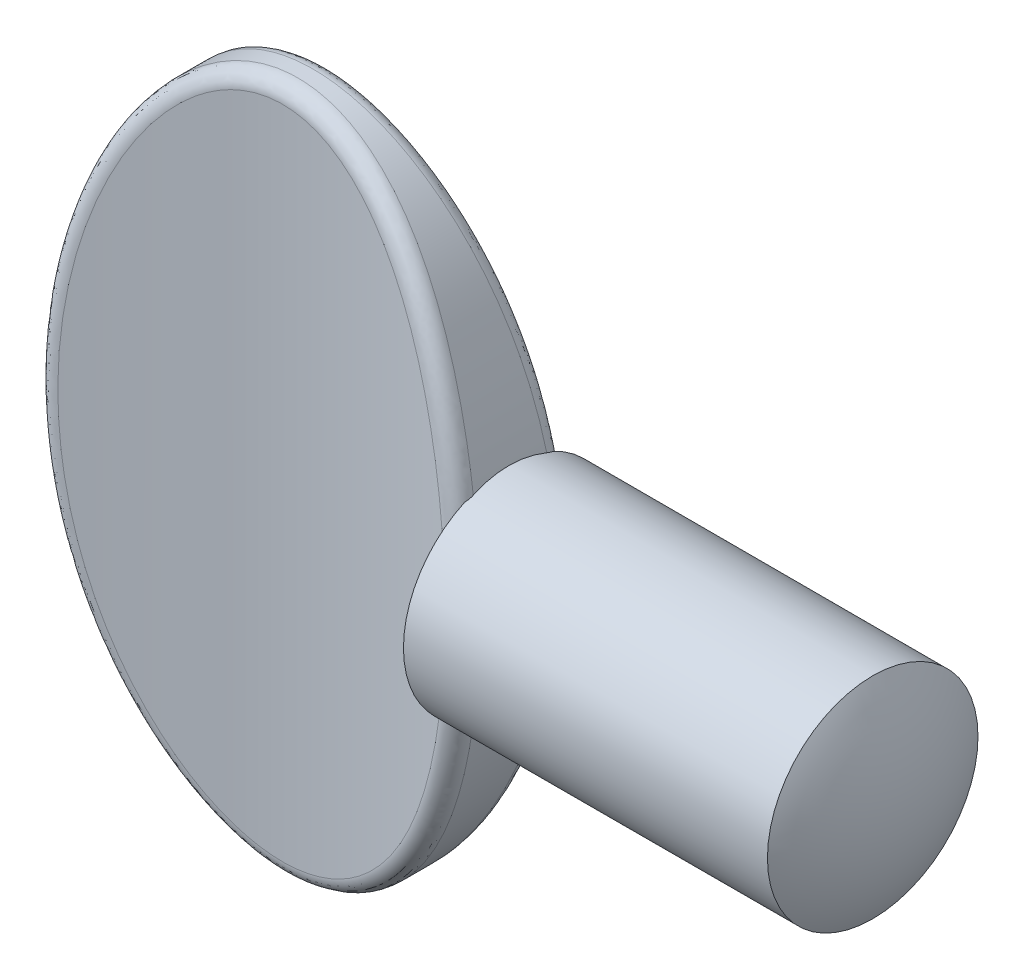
ISO-10303-21;
HEADER;
FILE_DESCRIPTION(('STEP AP214'),'2;1');
FILE_NAME('part.step','',(''),(''),'','','');
FILE_SCHEMA(('AUTOMOTIVE_DESIGN { 1 0 10303 214 1 1 1 1 }'));
ENDSEC;
DATA;
#1=APPLICATION_CONTEXT('core data for automotive mechanical design processes');
#2=APPLICATION_PROTOCOL_DEFINITION('international standard','automotive_design',2000,#1);
#3=PRODUCT_CONTEXT('',#1,'mechanical');
#4=PRODUCT('Part','Part','',(#3));
#5=PRODUCT_RELATED_PRODUCT_CATEGORY('part','',(#4));
#6=PRODUCT_DEFINITION_FORMATION('','',#4);
#7=PRODUCT_DEFINITION_CONTEXT('part definition',#1,'design');
#8=PRODUCT_DEFINITION('design','',#6,#7);
#9=PRODUCT_DEFINITION_SHAPE('','',#8);
#10=(LENGTH_UNIT() NAMED_UNIT(*) SI_UNIT(.MILLI.,.METRE.));
#11=(NAMED_UNIT(*) PLANE_ANGLE_UNIT() SI_UNIT($,.RADIAN.));
#12=(NAMED_UNIT(*) SI_UNIT($,.STERADIAN.) SOLID_ANGLE_UNIT());
#13=UNCERTAINTY_MEASURE_WITH_UNIT(LENGTH_MEASURE(1.E-05),#10,'distance_accuracy_value','');
#14=(GEOMETRIC_REPRESENTATION_CONTEXT(3) GLOBAL_UNCERTAINTY_ASSIGNED_CONTEXT((#13)) GLOBAL_UNIT_ASSIGNED_CONTEXT((#10,
#11,#12)) REPRESENTATION_CONTEXT('',''));
#15=CARTESIAN_POINT('',(0.,0.,0.));
#16=DIRECTION('',(0.,0.,1.));
#17=DIRECTION('',(1.,0.,0.));
#18=AXIS2_PLACEMENT_3D('',#15,#16,#17);
#19=CARTESIAN_POINT('',(0.,0.,1.016));
#20=DIRECTION('',(0.,0.,1.));
#21=DIRECTION('',(0.,-1.,0.));
#22=AXIS2_PLACEMENT_3D('',#19,#20,#21);
#23=ELLIPSE('',#22,5.715,3.556);
#24=DIRECTION('',(0.,0.,-1.));
#25=VECTOR('',#24,1.);
#26=SURFACE_OF_LINEAR_EXTRUSION('',#23,#25);
#27=CARTESIAN_POINT('',(3.41011531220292,-1.62014791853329,0.668376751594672));
#28=CARTESIAN_POINT('',(3.40671804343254,-1.63860905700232,0.623625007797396));
#29=CARTESIAN_POINT('',(3.40360222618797,-1.65521497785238,0.578110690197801));
#30=CARTESIAN_POINT('',(3.39801345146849,-1.68461510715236,0.485826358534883));
#31=CARTESIAN_POINT('',(3.39554052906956,-1.69740910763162,0.439056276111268));
#32=CARTESIAN_POINT('',(3.38920906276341,-1.72990576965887,0.297329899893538));
#33=CARTESIAN_POINT('',(3.38643361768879,-1.74374513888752,0.200903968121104));
#34=CARTESIAN_POINT('',(3.38412486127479,-1.75528275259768,0.00701645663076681));
#35=CARTESIAN_POINT('',(3.38459484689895,-1.75296458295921,-0.0904460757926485));
#36=CARTESIAN_POINT('',(3.38872446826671,-1.73223483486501,-0.283468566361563));
#37=CARTESIAN_POINT('',(3.39237835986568,-1.71385223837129,-0.379031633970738));
#38=CARTESIAN_POINT('',(3.39927526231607,-1.67798412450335,-0.507252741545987));
#39=CARTESIAN_POINT('',(3.40135032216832,-1.66710508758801,-0.541931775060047));
#40=CARTESIAN_POINT('',(3.40584397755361,-1.64323850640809,-0.610479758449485));
#41=CARTESIAN_POINT('',(3.4082620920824,-1.63025391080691,-0.64434976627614));
#42=CARTESIAN_POINT('',(3.41083461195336,-1.61623226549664,-0.677790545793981));
#43=B_SPLINE_CURVE_WITH_KNOTS('',3,(#27,#28,#29,#30,#31,#32,#33,#34,#35,#36,#37,#38,#39,#40,#41,
#42),.UNSPECIFIED.,.F.,.F.,(4,2,2,2,2,2,2,4),(0.,0.145499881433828,0.29100769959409,
0.581851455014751,0.872990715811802,1.16360581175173,1.2727648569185,1.381772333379),.UNSPECIFIED.);
#44=CARTESIAN_POINT('',(3.40596285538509,-1.64255427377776,0.611246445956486));
#45=VERTEX_POINT('',#44);
#46=CARTESIAN_POINT('',(3.40596285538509,-1.64255427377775,-0.611246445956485));
#47=VERTEX_POINT('',#46);
#48=EDGE_CURVE('E263',#45,#47,#43,.T.);
#49=ORIENTED_EDGE('',*,*,#48,.F.);
#50=CARTESIAN_POINT('',(2.87687361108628,2.44813994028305,0.791992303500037));
#51=CARTESIAN_POINT('',(3.18255529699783,2.5496565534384,0.881151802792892));
#52=CARTESIAN_POINT('',(3.19087427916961,2.52247577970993,0.548152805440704));
#53=CARTESIAN_POINT('',(2.94045219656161,2.23528015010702,0.810534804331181));
#54=CARTESIAN_POINT('',(3.25173180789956,2.32661822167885,0.903476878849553));
#55=CARTESIAN_POINT('',(3.25828081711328,2.30224582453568,0.567153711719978));
#56=CARTESIAN_POINT('',(2.99465455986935,2.01926969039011,0.826995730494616));
#57=CARTESIAN_POINT('',(3.31014106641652,2.10195664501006,0.923109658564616));
#58=CARTESIAN_POINT('',(3.31562682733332,2.07916028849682,0.584021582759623));
#59=CARTESIAN_POINT('',(3.08550522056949,1.5830552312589,0.85513976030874));
#60=CARTESIAN_POINT('',(3.40834569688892,1.6476446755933,0.956769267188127));
#61=CARTESIAN_POINT('',(3.41165763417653,1.62919353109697,0.61286138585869));
#62=CARTESIAN_POINT('',(3.12214641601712,1.36284957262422,0.866820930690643));
#63=CARTESIAN_POINT('',(3.4478175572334,1.41867397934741,0.970692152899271));
#64=CARTESIAN_POINT('',(3.45033488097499,1.40231081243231,0.624831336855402));
#65=CARTESIAN_POINT('',(3.17863710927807,0.919742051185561,0.885019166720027));
#66=CARTESIAN_POINT('',(3.50886358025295,0.957217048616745,0.992448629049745));
#67=CARTESIAN_POINT('',(3.50993638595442,0.946080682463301,0.643479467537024));
#68=CARTESIAN_POINT('',(3.19846897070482,0.696837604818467,0.891530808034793));
#69=CARTESIAN_POINT('',(3.53022382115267,0.725447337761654,1.00020785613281));
#70=CARTESIAN_POINT('',(3.53084199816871,0.716730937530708,0.650152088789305));
#71=CARTESIAN_POINT('',(3.22166889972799,0.250038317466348,0.89916161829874));
#72=CARTESIAN_POINT('',(3.55529121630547,0.260137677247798,1.00932947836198));
#73=CARTESIAN_POINT('',(3.55529615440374,0.257136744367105,0.657971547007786));
#74=CARTESIAN_POINT('',(3.22503654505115,0.0261434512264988,0.900280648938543));
#75=CARTESIAN_POINT('',(3.5589182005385,0.0273359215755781,1.0106627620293));
#76=CARTESIAN_POINT('',(3.55884425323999,0.0268922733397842,0.659118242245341));
#77=CARTESIAN_POINT('',(3.21529651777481,-0.424794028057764,0.897065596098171));
#78=CARTESIAN_POINT('',(3.54839475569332,-0.442282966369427,1.00681981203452));
#79=CARTESIAN_POINT('',(3.54857931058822,-0.436885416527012,0.655823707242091));
#80=CARTESIAN_POINT('',(3.20192627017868,-0.651830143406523,0.892644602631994));
#81=CARTESIAN_POINT('',(3.53399566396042,-0.678337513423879,1.00155250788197));
#82=CARTESIAN_POINT('',(3.53448957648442,-0.67041277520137,0.651293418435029));
#83=CARTESIAN_POINT('',(3.15798579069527,-1.10403389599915,0.878342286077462));
#84=CARTESIAN_POINT('',(3.48651511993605,-1.14926850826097,0.98445489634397));
#85=CARTESIAN_POINT('',(3.48815150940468,-1.13578713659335,0.636637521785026));
#86=CARTESIAN_POINT('',(3.12741141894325,-1.32920107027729,0.86845964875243));
#87=CARTESIAN_POINT('',(3.45358537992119,-1.38338047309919,0.972678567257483));
#88=CARTESIAN_POINT('',(3.45589880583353,-1.36763372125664,0.626510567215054));
#89=CARTESIAN_POINT('',(3.04849516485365,-1.77551295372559,0.843590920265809));
#90=CARTESIAN_POINT('',(3.36829281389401,-1.84818795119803,0.942941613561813));
#91=CARTESIAN_POINT('',(3.37255097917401,-1.82763853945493,0.601027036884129));
#92=CARTESIAN_POINT('',(3.00018846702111,-1.99666472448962,0.828614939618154));
#93=CARTESIAN_POINT('',(3.31625058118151,-2.07815631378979,0.925087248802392));
#94=CARTESIAN_POINT('',(3.32149316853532,-2.05580314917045,0.585680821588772));
#95=CARTESIAN_POINT('',(2.88476113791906,-2.43326023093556,0.79411239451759));
#96=CARTESIAN_POINT('',(3.19142384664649,-2.53294503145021,0.883801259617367));
#97=CARTESIAN_POINT('',(3.19926934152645,-2.50695447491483,0.550325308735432));
#98=CARTESIAN_POINT('',(2.81765268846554,-2.64870756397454,0.774588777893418));
#99=CARTESIAN_POINT('',(3.11906951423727,-2.75709243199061,0.860497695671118));
#100=CARTESIAN_POINT('',(3.12811634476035,-2.72994444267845,0.530319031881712));
#101=CARTESIAN_POINT('',(2.65311433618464,-3.0985151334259,0.729048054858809));
#102=CARTESIAN_POINT('',(2.94108253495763,-3.22556424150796,0.805967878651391));
#103=CARTESIAN_POINT('',(2.95319352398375,-3.19660978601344,0.483652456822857));
#104=CARTESIAN_POINT('',(2.55290441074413,-3.33177078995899,0.702519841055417));
#105=CARTESIAN_POINT('',(2.83297127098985,-3.46846636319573,0.774250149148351));
#106=CARTESIAN_POINT('',(2.84641629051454,-3.43928390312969,0.456468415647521));
#107=CARTESIAN_POINT('',(2.32320903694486,-3.78234312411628,0.64640489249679));
#108=CARTESIAN_POINT('',(2.58357223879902,-3.93908503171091,0.706749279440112));
#109=CARTESIAN_POINT('',(2.60051045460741,-3.91004049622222,0.398966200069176));
#110=CARTESIAN_POINT('',(2.19375678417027,-3.99967750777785,0.616821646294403));
#111=CARTESIAN_POINT('',(2.44340804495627,-4.16619911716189,0.671174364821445));
#112=CARTESIAN_POINT('',(2.4614185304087,-4.138139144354,0.368651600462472));
#113=CARTESIAN_POINT('',(1.94091533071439,-4.3535976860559,0.565411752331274));
#114=CARTESIAN_POINT('',(2.16660546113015,-4.53837771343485,0.608745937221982));
#115=CARTESIAN_POINT('',(2.18768136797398,-4.51205711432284,0.315970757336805));
#116=CARTESIAN_POINT('',(1.82542698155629,-4.49608375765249,0.543660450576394));
#117=CARTESIAN_POINT('',(2.04053515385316,-4.68812354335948,0.582339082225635));
#118=CARTESIAN_POINT('',(2.06208689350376,-4.66339853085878,0.29368172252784));
#119=CARTESIAN_POINT('',(1.57466794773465,-4.76186582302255,0.501591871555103));
#120=CARTESIAN_POINT('',(1.76506012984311,-4.96825132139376,0.530990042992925));
#121=CARTESIAN_POINT('',(1.78731476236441,-4.94761823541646,0.250573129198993));
#122=CARTESIAN_POINT('',(1.43943196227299,-4.88519470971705,0.481272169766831));
#123=CARTESIAN_POINT('',(1.61619495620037,-5.09885836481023,0.506044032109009));
#124=CARTESIAN_POINT('',(1.63817843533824,-5.08052812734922,0.229751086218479));
#125=CARTESIAN_POINT('',(1.1911972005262,-5.07171066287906,0.449763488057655));
#126=CARTESIAN_POINT('',(1.340429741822,-5.29730303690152,0.467084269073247));
#127=CARTESIAN_POINT('',(1.36169787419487,-5.28324603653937,0.197463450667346));
#128=CARTESIAN_POINT('',(1.08336860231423,-5.14191532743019,0.437647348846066));
#129=CARTESIAN_POINT('',(1.22051144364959,-5.3722217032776,0.452038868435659));
#130=CARTESIAN_POINT('',(1.24085897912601,-5.36011289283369,0.185047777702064));
#131=CARTESIAN_POINT('',(0.858050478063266,-5.26424468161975,0.416270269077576));
#132=CARTESIAN_POINT('',(0.968834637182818,-5.50292549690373,0.42542157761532));
#133=CARTESIAN_POINT('',(0.986440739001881,-5.49490642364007,0.163142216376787));
#134=CARTESIAN_POINT('',(0.740575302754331,-5.31639564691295,0.407005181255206));
#135=CARTESIAN_POINT('',(0.836995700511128,-5.5590377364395,0.413787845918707));
#136=CARTESIAN_POINT('',(0.85288027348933,-5.55286061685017,0.153648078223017));
#137=CARTESIAN_POINT('',(0.515993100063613,-5.39221579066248,0.393443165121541));
#138=CARTESIAN_POINT('',(0.584104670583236,-5.64060692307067,0.396743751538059));
#139=CARTESIAN_POINT('',(0.595858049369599,-5.63753360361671,0.139750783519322));
#140=CARTESIAN_POINT('',(0.409913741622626,-5.41895204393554,0.38861490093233));
#141=CARTESIAN_POINT('',(0.464186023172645,-5.66954672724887,0.390631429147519));
#142=CARTESIAN_POINT('',(0.473813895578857,-5.66759942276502,0.134803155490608));
#143=CARTESIAN_POINT('',(0.194791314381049,-5.45394261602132,0.382284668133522));
#144=CARTESIAN_POINT('',(0.220889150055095,-5.70732589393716,0.382635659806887));
#145=CARTESIAN_POINT('',(0.225513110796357,-5.70700859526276,0.128316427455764));
#146=CARTESIAN_POINT('',(0.0857502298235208,-5.46220901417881,0.380780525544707));
#147=CARTESIAN_POINT('',(0.0971189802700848,-5.71630681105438,0.380722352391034));
#148=CARTESIAN_POINT('',(0.0992592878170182,-5.71636549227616,0.126775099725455));
#149=CARTESIAN_POINT('',(-0.132181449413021,-5.45950203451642,0.381271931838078));
#150=CARTESIAN_POINT('',(-0.149751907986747,-5.71338033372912,0.381344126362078));
#151=CARTESIAN_POINT('',(-0.15300824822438,-5.71330808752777,0.127278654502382));
#152=CARTESIAN_POINT('',(-0.24107184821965,-5.44851292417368,0.383270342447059));
#153=CARTESIAN_POINT('',(-0.27330895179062,-5.70144504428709,0.383885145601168));
#154=CARTESIAN_POINT('',(-0.27902168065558,-5.70087598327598,0.129326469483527));
#155=CARTESIAN_POINT('',(-0.455477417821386,-5.40829096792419,0.390538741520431));
#156=CARTESIAN_POINT('',(-0.515669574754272,-5.65803605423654,0.393060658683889));
#157=CARTESIAN_POINT('',(-0.526267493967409,-5.65561592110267,0.136774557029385));
#158=CARTESIAN_POINT('',(-0.560990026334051,-5.37904460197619,0.395811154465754));
#159=CARTESIAN_POINT('',(-0.634846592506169,-5.62640367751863,0.399728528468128));
#160=CARTESIAN_POINT('',(-0.647496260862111,-5.62277284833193,0.142177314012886));
#161=CARTESIAN_POINT('',(-0.791362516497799,-5.29549090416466,0.410722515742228));
#162=CARTESIAN_POINT('',(-0.894095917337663,-5.53655861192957,0.418454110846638));
#163=CARTESIAN_POINT('',(-0.910741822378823,-5.52960626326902,0.157457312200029));
#164=CARTESIAN_POINT('',(-0.914651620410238,-5.23680665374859,0.421113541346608));
#165=CARTESIAN_POINT('',(-1.03227791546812,-5.4734725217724,0.431484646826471));
#166=CARTESIAN_POINT('',(-1.05060182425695,-5.46452941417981,0.168105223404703));
#167=CARTESIAN_POINT('',(-1.1501410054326,-5.1000145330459,0.444888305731));
#168=CARTESIAN_POINT('',(-1.29493907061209,-5.32749236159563,0.461037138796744));
#169=CARTESIAN_POINT('',(-1.31582055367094,-5.31418719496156,0.192467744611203));
#170=CARTESIAN_POINT('',(-1.26232097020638,-5.02187196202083,0.458277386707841));
#171=CARTESIAN_POINT('',(-1.41945940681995,-5.24422211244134,0.477628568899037));
#172=CARTESIAN_POINT('',(-1.44115278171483,-5.22888577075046,0.20618782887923));
#173=CARTESIAN_POINT('',(-1.52425358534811,-4.81141848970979,0.493480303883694));
#174=CARTESIAN_POINT('',(-1.71006807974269,-5.02053132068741,0.521084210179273));
#175=CARTESIAN_POINT('',(-1.73197783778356,-5.00086686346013,0.242261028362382));
#176=CARTESIAN_POINT('',(-1.66743267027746,-4.67075761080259,0.516329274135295));
#177=CARTESIAN_POINT('',(-1.86727379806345,-4.87182691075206,0.549058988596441));
#178=CARTESIAN_POINT('',(-1.88928718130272,-4.84982635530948,0.265674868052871));
#179=CARTESIAN_POINT('',(-1.93076565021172,-4.36861808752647,0.56315778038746));
#180=CARTESIAN_POINT('',(-2.15601250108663,-4.55386893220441,0.606083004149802));
#181=CARTESIAN_POINT('',(-2.17678970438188,-4.52789876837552,0.313661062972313));
#182=CARTESIAN_POINT('',(-2.05086652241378,-4.20709289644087,0.587139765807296));
#183=CARTESIAN_POINT('',(-2.28680032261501,-4.38442619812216,0.63511216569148));
#184=CARTESIAN_POINT('',(-2.30692049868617,-4.35696740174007,0.338235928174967));
#185=CARTESIAN_POINT('',(-2.24774440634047,-3.90468381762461,0.629494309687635));
#186=CARTESIAN_POINT('',(-2.50094051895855,-4.06830128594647,0.686196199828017));
#187=CARTESIAN_POINT('',(-2.51931723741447,-4.03858337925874,0.38163755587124));
#188=CARTESIAN_POINT('',(-2.32835126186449,-3.7663893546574,0.648005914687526));
#189=CARTESIAN_POINT('',(-2.58844569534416,-3.92375543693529,0.708482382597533));
#190=CARTESIAN_POINT('',(-2.60592272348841,-3.89353451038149,0.400606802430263));
#191=CARTESIAN_POINT('',(-2.47764655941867,-3.48301662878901,0.68392178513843));
#192=CARTESIAN_POINT('',(-2.750598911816,-3.62773016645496,0.751698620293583));
#193=CARTESIAN_POINT('',(-2.76590357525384,-3.59720408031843,0.437410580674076));
#194=CARTESIAN_POINT('',(-2.54632812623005,-3.33793451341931,0.701325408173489));
#195=CARTESIAN_POINT('',(-2.82495665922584,-3.4763903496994,0.772577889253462));
#196=CARTESIAN_POINT('',(-2.83927131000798,-3.44591898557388,0.455244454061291));
#197=CARTESIAN_POINT('',(-2.73596214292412,-2.89487609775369,0.751105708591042));
#198=CARTESIAN_POINT('',(-3.03164049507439,-3.01174573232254,0.832642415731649));
#199=CARTESIAN_POINT('',(-3.04146428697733,-2.98492820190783,0.506255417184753));
#200=CARTESIAN_POINT('',(-2.84046694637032,-2.58914736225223,0.781043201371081));
#201=CARTESIAN_POINT('',(-3.1439027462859,-2.69404108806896,0.868280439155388));
#202=CARTESIAN_POINT('',(-3.15233965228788,-2.66814963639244,0.53693302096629));
#203=CARTESIAN_POINT('',(-3.02361670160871,-1.91917408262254,0.835455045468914));
#204=CARTESIAN_POINT('',(-3.34221273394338,-1.99525212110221,0.933484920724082));
#205=CARTESIAN_POINT('',(-3.34632626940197,-1.97562309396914,0.592690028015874));
#206=CARTESIAN_POINT('',(-3.09598835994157,-1.55305613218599,0.858425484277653));
#207=CARTESIAN_POINT('',(-3.41971506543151,-1.61558535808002,0.960711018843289));
#208=CARTESIAN_POINT('',(-3.42273238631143,-1.59818444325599,0.616228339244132));
#209=CARTESIAN_POINT('',(-3.19389380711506,-0.813438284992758,0.889906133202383));
#210=CARTESIAN_POINT('',(-3.52551559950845,-0.845326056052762,0.998352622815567));
#211=CARTESIAN_POINT('',(-3.52603668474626,-0.836598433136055,0.648487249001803));
#212=CARTESIAN_POINT('',(-3.219394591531,-0.439933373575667,0.898406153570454));
#213=CARTESIAN_POINT('',(-3.55284253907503,-0.458062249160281,1.00842962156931));
#214=CARTESIAN_POINT('',(-3.55289998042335,-0.452446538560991,0.657197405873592));
#215=CARTESIAN_POINT('',(-3.22377462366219,0.165515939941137,0.899871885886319));
#216=CARTESIAN_POINT('',(-3.55753925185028,0.172415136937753,1.01016840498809));
#217=CARTESIAN_POINT('',(-3.55751322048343,0.170223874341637,0.658699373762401));
#218=CARTESIAN_POINT('',(-3.21666132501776,0.397456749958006,0.897504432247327));
#219=CARTESIAN_POINT('',(-3.54988979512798,0.413553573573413,1.00735185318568));
#220=CARTESIAN_POINT('',(-3.55001934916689,0.408752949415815,0.656273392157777));
#221=CARTESIAN_POINT('',(-3.18467556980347,0.860036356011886,0.887014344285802));
#222=CARTESIAN_POINT('',(-3.51533559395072,0.895293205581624,0.994814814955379));
#223=CARTESIAN_POINT('',(-3.5162998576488,0.884649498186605,0.645523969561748));
#224=CARTESIAN_POINT('',(-3.15979714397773,1.09067468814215,0.878889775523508));
#225=CARTESIAN_POINT('',(-3.48854259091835,1.1350753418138,0.9851346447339));
#226=CARTESIAN_POINT('',(-3.49006794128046,1.12201655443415,0.637198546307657));
#227=CARTESIAN_POINT('',(-3.09177046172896,1.54865418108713,0.857163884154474));
#228=CARTESIAN_POINT('',(-3.41502593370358,1.61202494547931,0.959158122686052));
#229=CARTESIAN_POINT('',(-3.41826670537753,1.59374884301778,0.614935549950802));
#230=CARTESIAN_POINT('',(-3.04863796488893,1.77599801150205,0.843567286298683));
#231=CARTESIAN_POINT('',(-3.36857207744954,1.84840189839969,0.942954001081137));
#232=CARTESIAN_POINT('',(-3.37271406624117,1.82811648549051,0.601002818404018));
#233=CARTESIAN_POINT('',(-2.94317111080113,2.22543485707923,0.811418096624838));
#234=CARTESIAN_POINT('',(-3.25454291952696,2.31651004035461,0.904496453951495));
#235=CARTESIAN_POINT('',(-3.26114490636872,2.29208476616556,0.568058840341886));
#236=CARTESIAN_POINT('',(-2.88084877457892,2.44753106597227,0.792868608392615));
#237=CARTESIAN_POINT('',(-3.18737593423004,2.54750357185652,0.882369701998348));
#238=CARTESIAN_POINT('',(-3.1951411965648,2.52168829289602,0.549050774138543));
#239=CARTESIAN_POINT('',(-2.72296807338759,2.92171701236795,0.747996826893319));
#240=CARTESIAN_POINT('',(-3.01671846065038,3.04112688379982,0.828682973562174));
#241=CARTESIAN_POINT('',(-3.02753524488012,3.01295829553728,0.503069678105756));
#242=CARTESIAN_POINT('',(-2.62354531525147,3.17242818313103,0.720887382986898));
#243=CARTESIAN_POINT('',(-2.9095837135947,3.3020505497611,0.796309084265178));
#244=CARTESIAN_POINT('',(-2.92177195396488,3.27338041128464,0.475290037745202));
#245=CARTESIAN_POINT('',(-2.45047373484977,3.53592668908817,0.677330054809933));
#246=CARTESIAN_POINT('',(-2.72089131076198,3.68328686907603,0.743720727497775));
#247=CARTESIAN_POINT('',(-2.73679732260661,3.65249750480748,0.430655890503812));
#248=CARTESIAN_POINT('',(-2.38881716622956,3.6549621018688,0.662334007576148));
#249=CARTESIAN_POINT('',(-2.65403373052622,3.80757139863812,0.725698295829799));
#250=CARTESIAN_POINT('',(-2.6707761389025,3.77691258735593,0.415289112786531));
#251=CARTESIAN_POINT('',(-2.25689122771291,3.88780573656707,0.631713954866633));
#252=CARTESIAN_POINT('',(-2.51060863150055,4.0509787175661,0.688809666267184));
#253=CARTESIAN_POINT('',(-2.52910566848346,4.02092289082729,0.383912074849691));
#254=CARTESIAN_POINT('',(-2.18662455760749,4.00161558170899,0.616090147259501));
#255=CARTESIAN_POINT('',(-2.43421779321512,4.17003284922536,0.669971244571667));
#256=CARTESIAN_POINT('',(-2.45345939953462,4.14051960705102,0.367902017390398));
#257=CARTESIAN_POINT('',(-2.00630311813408,4.26762511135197,0.578214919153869));
#258=CARTESIAN_POINT('',(-2.23805461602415,4.4481030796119,0.624273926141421));
#259=CARTESIAN_POINT('',(-2.25863520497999,4.42099703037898,0.329090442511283));
#260=CARTESIAN_POINT('',(-1.89168515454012,4.4166251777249,0.555850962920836));
#261=CARTESIAN_POINT('',(-2.11309442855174,4.60451461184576,0.597170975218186));
#262=CARTESIAN_POINT('',(-2.1342612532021,4.57889839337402,0.306173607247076));
#263=CARTESIAN_POINT('',(-1.64204982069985,4.69578543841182,0.512276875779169));
#264=CARTESIAN_POINT('',(-1.83921681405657,4.89842163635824,0.544072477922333));
#265=CARTESIAN_POINT('',(-1.86139526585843,4.87668575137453,0.261522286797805));
#266=CARTESIAN_POINT('',(-1.50706569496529,4.82597567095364,0.491064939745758));
#267=CARTESIAN_POINT('',(-1.69088789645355,5.03609559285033,0.518086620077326));
#268=CARTESIAN_POINT('',(-1.71294250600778,5.01660042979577,0.239785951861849));
#269=CARTESIAN_POINT('',(-1.25822257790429,5.02460380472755,0.457805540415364));
#270=CARTESIAN_POINT('',(-1.41485811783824,5.24717231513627,0.477035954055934));
#271=CARTESIAN_POINT('',(-1.43656618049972,5.23187493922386,0.205704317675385));
#272=CARTESIAN_POINT('',(-1.14977220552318,5.09995591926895,0.444894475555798));
#273=CARTESIAN_POINT('',(-1.29446557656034,5.32746078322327,0.461038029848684));
#274=CARTESIAN_POINT('',(-1.3153835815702,5.31413478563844,0.192474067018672));
#275=CARTESIAN_POINT('',(-0.922470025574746,5.23252776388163,0.421861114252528));
#276=CARTESIAN_POINT('',(-1.04096461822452,5.4689251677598,0.432410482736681));
#277=CARTESIAN_POINT('',(-1.0594278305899,5.45981518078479,0.16887127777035));
#278=CARTESIAN_POINT('',(-0.80363402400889,5.28977445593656,0.41173467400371));
#279=CARTESIAN_POINT('',(-0.907817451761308,5.53043531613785,0.419719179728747));
#280=CARTESIAN_POINT('',(-0.924675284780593,5.5232637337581,0.158494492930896));
#281=CARTESIAN_POINT('',(-0.577455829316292,5.37398354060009,0.39672020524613));
#282=CARTESIAN_POINT('',(-0.653408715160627,5.62094693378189,0.40087394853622));
#283=CARTESIAN_POINT('',(-0.666376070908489,5.6171058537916,0.143108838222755));
#284=CARTESIAN_POINT('',(-0.471370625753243,5.4043497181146,0.391249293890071));
#285=CARTESIAN_POINT('',(-0.5336224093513,5.65378212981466,0.393957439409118));
#286=CARTESIAN_POINT('',(-0.544550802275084,5.65118930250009,0.13750267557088));
#287=CARTESIAN_POINT('',(-0.255633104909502,5.44661210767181,0.38361532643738));
#288=CARTESIAN_POINT('',(-0.289803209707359,5.69938537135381,0.384322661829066));
#289=CARTESIAN_POINT('',(-0.295851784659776,5.69872932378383,0.129679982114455));
#290=CARTESIAN_POINT('',(-0.145983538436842,5.45852223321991,0.38144977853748));
#291=CARTESIAN_POINT('',(-0.165395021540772,5.71232072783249,0.381569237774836));
#292=CARTESIAN_POINT('',(-0.168981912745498,5.71220143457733,0.127460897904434));
#293=CARTESIAN_POINT('',(0.0738869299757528,5.46278107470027,0.380676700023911));
#294=CARTESIAN_POINT('',(0.0836678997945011,5.7169249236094,0.380591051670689));
#295=CARTESIAN_POINT('',(0.0855232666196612,5.71701154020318,0.126668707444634));
#296=CARTESIAN_POINT('',(0.184108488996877,5.45509623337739,0.382075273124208));
#297=CARTESIAN_POINT('',(0.208792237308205,5.70857455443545,0.382370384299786));
#298=CARTESIAN_POINT('',(0.21315951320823,5.70831156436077,0.128101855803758));
#299=CARTESIAN_POINT('',(0.401619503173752,5.42083768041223,0.38827437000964));
#300=CARTESIAN_POINT('',(0.454815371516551,5.67158273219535,0.390201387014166));
#301=CARTESIAN_POINT('',(0.464261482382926,5.66972014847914,0.134454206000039));
#302=CARTESIAN_POINT('',(0.50890688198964,5.3942509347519,0.393077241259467));
#303=CARTESIAN_POINT('',(0.576122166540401,5.64279808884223,0.39628327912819));
#304=CARTESIAN_POINT('',(0.587724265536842,5.63981408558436,0.13937581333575));
#305=CARTESIAN_POINT('',(0.739415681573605,5.31719606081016,0.40686416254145));
#306=CARTESIAN_POINT('',(0.83573942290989,5.55988553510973,0.41361366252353));
#307=CARTESIAN_POINT('',(0.851580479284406,5.55374603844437,0.153503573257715));
#308=CARTESIAN_POINT('',(0.861383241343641,5.26294420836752,0.416504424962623));
#309=CARTESIAN_POINT('',(0.972626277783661,5.50149772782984,0.425721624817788));
#310=CARTESIAN_POINT('',(0.990242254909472,5.49345262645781,0.163382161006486));
#311=CARTESIAN_POINT('',(1.0949077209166,5.13510542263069,0.438830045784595));
#312=CARTESIAN_POINT('',(1.23342883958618,5.36492676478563,0.453514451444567));
#313=CARTESIAN_POINT('',(1.2538468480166,5.35263149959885,0.186259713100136));
#314=CARTESIAN_POINT('',(1.20644657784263,5.06148575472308,0.451520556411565));
#315=CARTESIAN_POINT('',(1.35742533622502,5.28637625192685,0.469268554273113));
#316=CARTESIAN_POINT('',(1.37876592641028,5.2720695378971,0.199263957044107));
#317=CARTESIAN_POINT('',(1.46573802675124,4.86335533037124,0.484912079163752));
#318=CARTESIAN_POINT('',(1.64542638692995,5.0755944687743,0.510545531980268));
#319=CARTESIAN_POINT('',(1.66733639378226,5.05689690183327,0.233480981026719));
#320=CARTESIAN_POINT('',(1.60745261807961,4.73079185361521,0.506661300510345));
#321=CARTESIAN_POINT('',(1.80127145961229,4.93527393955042,0.537224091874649));
#322=CARTESIAN_POINT('',(1.82341116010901,4.914206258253,0.255767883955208));
#323=CARTESIAN_POINT('',(1.86900175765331,4.44495554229,0.551550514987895));
#324=CARTESIAN_POINT('',(2.08839377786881,4.63419132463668,0.591965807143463));
#325=CARTESIAN_POINT('',(2.10960205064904,4.60897313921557,0.301766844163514));
#326=CARTESIAN_POINT('',(1.98878809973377,4.29163833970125,0.574693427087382));
#327=CARTESIAN_POINT('',(2.21900804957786,4.47319746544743,0.620024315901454));
#328=CARTESIAN_POINT('',(2.23966103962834,4.44638820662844,0.32548189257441));
#329=CARTESIAN_POINT('',(2.18584389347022,4.00402857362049,0.615817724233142));
#330=CARTESIAN_POINT('',(2.43354527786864,4.17232015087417,0.669684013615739));
#331=CARTESIAN_POINT('',(2.45265033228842,4.14301394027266,0.367622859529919));
#332=CARTESIAN_POINT('',(2.26678612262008,3.87233883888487,0.633878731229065));
#333=CARTESIAN_POINT('',(2.52149542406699,4.03457978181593,0.691453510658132));
#334=CARTESIAN_POINT('',(2.5397676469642,4.00465027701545,0.386130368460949));
#335=CARTESIAN_POINT('',(2.4172945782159,3.60212171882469,0.669113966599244));
#336=CARTESIAN_POINT('',(2.68508948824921,3.75215155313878,0.733890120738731));
#337=CARTESIAN_POINT('',(2.70131013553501,3.72162071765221,0.422236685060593));
#338=CARTESIAN_POINT('',(2.48685442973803,3.463590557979,0.686287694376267));
#339=CARTESIAN_POINT('',(2.76046142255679,3.60757416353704,0.754513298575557));
#340=CARTESIAN_POINT('',(2.77572819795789,3.57695134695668,0.439834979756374));
#341=CARTESIAN_POINT('',(2.61551558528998,3.18118784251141,0.71926816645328));
#342=CARTESIAN_POINT('',(2.89998706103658,3.31289252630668,0.794118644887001));
#343=CARTESIAN_POINT('',(2.91309166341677,3.28272006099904,0.473630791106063));
#344=CARTESIAN_POINT('',(2.6746042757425,3.03731009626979,0.73507325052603));
#345=CARTESIAN_POINT('',(2.96389868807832,3.16294480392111,0.813050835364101));
#346=CARTESIAN_POINT('',(2.97602323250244,3.13315249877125,0.489826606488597));
#347=CARTESIAN_POINT('',(2.78296275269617,2.74552013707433,0.764925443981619));
#348=CARTESIAN_POINT('',(3.08122852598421,2.85877616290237,0.84882953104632));
#349=CARTESIAN_POINT('',(3.09125015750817,2.83035190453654,0.520416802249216));
#350=CARTESIAN_POINT('',(2.83222971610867,2.59760677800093,0.778972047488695));
#351=CARTESIAN_POINT('',(3.13445317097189,2.70474702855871,0.865627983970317));
#352=CARTESIAN_POINT('',(3.14354245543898,2.67711783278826,0.534810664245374));
#353=CARTESIAN_POINT('',(2.87687361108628,2.44813994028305,0.791992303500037));
#354=CARTESIAN_POINT('',(3.18255529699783,2.5496565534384,0.881151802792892));
#355=CARTESIAN_POINT('',(3.19087427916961,2.52247577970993,0.548152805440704));
#356=(BOUNDED_SURFACE() B_SPLINE_SURFACE(3,2,((#50,#51,#52),(#53,#54,#55),(#56,#57,#58),(#59,
#60,#61),(#62,#63,#64),(#65,#66,#67),(#68,#69,#70),(#71,#72,#73),(#74,#75,#76),(#77,#78,#79),
(#80,#81,#82),(#83,#84,#85),(#86,#87,#88),(#89,#90,#91),(#92,#93,#94),(#95,#96,#97),(#98,#99,
#100),(#101,#102,#103),(#104,#105,#106),(#107,#108,#109),(#110,#111,#112),(#113,#114,#115),
(#116,#117,#118),(#119,#120,#121),(#122,#123,#124),(#125,#126,#127),(#128,#129,#130),(#131,#132,
#133),(#134,#135,#136),(#137,#138,#139),(#140,#141,#142),(#143,#144,#145),(#146,#147,#148),
(#149,#150,#151),(#152,#153,#154),(#155,#156,#157),(#158,#159,#160),(#161,#162,#163),(#164,#165,
#166),(#167,#168,#169),(#170,#171,#172),(#173,#174,#175),(#176,#177,#178),(#179,#180,#181),
(#182,#183,#184),(#185,#186,#187),(#188,#189,#190),(#191,#192,#193),(#194,#195,#196),(#197,#198,
#199),(#200,#201,#202),(#203,#204,#205),(#206,#207,#208),(#209,#210,#211),(#212,#213,#214),
(#215,#216,#217),(#218,#219,#220),(#221,#222,#223),(#224,#225,#226),(#227,#228,#229),(#230,#231,
#232),(#233,#234,#235),(#236,#237,#238),(#239,#240,#241),(#242,#243,#244),(#245,#246,#247),
(#248,#249,#250),(#251,#252,#253),(#254,#255,#256),(#257,#258,#259),(#260,#261,#262),(#263,#264,
#265),(#266,#267,#268),(#269,#270,#271),(#272,#273,#274),(#275,#276,#277),(#278,#279,#280),
(#281,#282,#283),(#284,#285,#286),(#287,#288,#289),(#290,#291,#292),(#293,#294,#295),(#296,#297,
#298),(#299,#300,#301),(#302,#303,#304),(#305,#306,#307),(#308,#309,#310),(#311,#312,#313),
(#314,#315,#316),(#317,#318,#319),(#320,#321,#322),(#323,#324,#325),(#326,#327,#328),(#329,#330,
#331),(#332,#333,#334),(#335,#336,#337),(#338,#339,#340),(#341,#342,#343),(#344,#345,#346),
(#347,#348,#349),(#350,#351,#352),(#353,#354,#355)),.UNSPECIFIED.,.T.,.F.,
.F.) B_SPLINE_SURFACE_WITH_KNOTS((4,2,2,2,2,2,2,2,2,2,2,2,2,2,2,2,2,2,2,2,2,2,2,2,2,2,2,2,2,2,2,
2,2,2,2,2,2,2,2,2,2,2,2,2,2,2,2,2,2,2,4),(3,3),(0.,0.670088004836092,1.34044677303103,
2.01150801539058,2.68258646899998,3.36432560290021,4.04622885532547,4.72678632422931,
5.40690386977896,6.17399274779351,6.94021517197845,7.49835151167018,8.05551867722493,
8.44869733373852,8.84130132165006,9.17597761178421,9.51043495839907,9.8451656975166,
10.1801446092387,10.5969595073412,11.0145231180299,11.6249253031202,12.2367135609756,
12.7226461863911,13.2088580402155,14.1814928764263,15.3007522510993,16.4207994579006,
17.116313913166,17.8120621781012,18.5072109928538,19.2019252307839,20.0156340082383,
20.4222285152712,20.8286958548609,21.4003838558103,21.9711485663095,22.3745805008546,
22.7774087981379,23.1149751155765,23.4522868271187,23.7901765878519,24.1282995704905,
24.5358772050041,24.9441481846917,25.5345239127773,26.1261823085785,26.5957484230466,
27.0655766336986,27.5359670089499,28.0064923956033),(0.,1.),
.UNSPECIFIED.) GEOMETRIC_REPRESENTATION_ITEM() RATIONAL_B_SPLINE_SURFACE(((1.,0.605083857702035,
1.),(1.,0.601611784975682,1.),(1.,0.5986115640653,1.),(1.,0.59355041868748,1.),(1.,
0.591489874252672,1.),(1.,0.588302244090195,1.),(1.,0.587176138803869,1.),(1.,0.585858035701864,
1.),(1.,0.585666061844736,1.),(1.,0.586220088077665,1.),(1.,0.586981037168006,1.),(1.,
0.589468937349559,1.),(1.,0.591196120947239,1.),(1.,0.59561711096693,1.),(1.,0.598309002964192,
1.),(1.,0.60466419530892,1.),(1.,0.6083268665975,1.),(1.,0.617156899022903,1.),(1.,
0.622456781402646,1.),(1.,0.634262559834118,1.),(1.,0.640767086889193,1.),(1.,0.652862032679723,
1.),(1.,0.658220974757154,1.),(1.,0.669205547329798,1.),(1.,0.674830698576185,1.),(1.,
0.684105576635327,1.),(1.,0.687849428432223,1.),(1.,0.69472599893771,1.),(1.,0.697859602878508,
1.),(1.,0.702576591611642,1.),(1.,0.704320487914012,1.),(1.,0.70662574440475,1.),(1.,
0.707187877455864,1.),(1.,0.707006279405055,1.),(1.,0.706261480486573,1.),(1.,0.70362723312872,
1.),(1.,0.701736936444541,1.),(1.,0.696594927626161,1.),(1.,0.693123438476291,1.),(1.,
0.685596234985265,1.),(1.,0.681539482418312,1.),(1.,0.671400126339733,1.),(1.,0.665247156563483,
1.),(1.,0.653377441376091,1.),(1.,0.647661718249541,1.),(1.,0.638021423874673,1.),(1.,
0.633970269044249,1.),(1.,0.626341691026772,1.),(1.,0.622764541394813,1.),(1.,0.612770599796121,
1.),(1.,0.607093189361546,1.),(1.,0.597028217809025,1.),(1.,0.592964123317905,1.),(1.,
0.587442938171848,1.),(1.,0.585987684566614,1.),(1.,0.585737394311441,1.),(1.,0.586143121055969,
1.),(1.,0.587958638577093,1.),(1.,0.589368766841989,1.),(1.,0.593196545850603,1.),(1.,
0.595613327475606,1.),(1.,0.601457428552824,1.),(1.,0.604884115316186,1.),(1.,0.613433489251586,
1.),(1.,0.618746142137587,1.),(1.,0.627733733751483,1.),(1.,0.630898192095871,1.),(1.,
0.6375502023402,1.),(1.,0.641037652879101,1.),(1.,0.649782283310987,1.),(1.,0.655182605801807,
1.),(1.,0.666333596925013,1.),(1.,0.672083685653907,1.),(1.,0.681684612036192,1.),(1.,
0.685598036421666,1.),(1.,0.692883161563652,1.),(1.,0.69625566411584,1.),(1.,0.701416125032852,
1.),(1.,0.703372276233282,1.),(1.,0.706134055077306,1.),(1.,0.706940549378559,1.),(1.,
0.707226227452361,1.),(1.,0.70670313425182,1.),(1.,0.704443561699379,1.),(1.,0.702706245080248,
1.),(1.,0.69790604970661,1.),(1.,0.694644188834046,1.),(1.,0.687475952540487,1.),(1.,
0.683568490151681,1.),(1.,0.673792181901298,1.),(1.,0.667825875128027,1.),(1.,0.65623775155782,
1.),(1.,0.650616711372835,1.),(1.,0.64108568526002,1.),(1.,0.637061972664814,1.),(1.,
0.629448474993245,1.),(1.,0.625858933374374,1.),(1.,0.619133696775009,1.),(1.,0.615998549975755,
1.),(1.,0.610192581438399,1.),(1.,0.607521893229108,1.),(1.,0.605083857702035,1.))) REPRESENTATION_ITEM('') SURFACE());
#357=CARTESIAN_POINT('',(3.19087427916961,2.52247577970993,0.548152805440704));
#358=CARTESIAN_POINT('',(3.25828081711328,2.30224582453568,0.567153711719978));
#359=CARTESIAN_POINT('',(3.31562682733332,2.07916028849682,0.584021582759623));
#360=CARTESIAN_POINT('',(3.41165763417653,1.62919353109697,0.61286138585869));
#361=CARTESIAN_POINT('',(3.45033488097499,1.40231081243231,0.624831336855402));
#362=CARTESIAN_POINT('',(3.50993638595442,0.946080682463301,0.643479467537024));
#363=CARTESIAN_POINT('',(3.5308419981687,0.716730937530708,0.650152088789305));
#364=CARTESIAN_POINT('',(3.55529615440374,0.257136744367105,0.657971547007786));
#365=CARTESIAN_POINT('',(3.55884425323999,0.0268922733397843,0.659118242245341));
#366=CARTESIAN_POINT('',(3.54857931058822,-0.436885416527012,0.655823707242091));
#367=CARTESIAN_POINT('',(3.53448957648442,-0.67041277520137,0.651293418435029));
#368=CARTESIAN_POINT('',(3.48815150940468,-1.13578713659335,0.636637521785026));
#369=CARTESIAN_POINT('',(3.45589880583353,-1.36763372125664,0.626510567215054));
#370=CARTESIAN_POINT('',(3.37255097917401,-1.82763853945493,0.601027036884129));
#371=CARTESIAN_POINT('',(3.32149316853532,-2.05580314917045,0.585680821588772));
#372=CARTESIAN_POINT('',(3.19926934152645,-2.50695447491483,0.550325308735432));
#373=CARTESIAN_POINT('',(3.12811634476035,-2.72994444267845,0.530319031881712));
#374=CARTESIAN_POINT('',(2.95319352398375,-3.19660978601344,0.483652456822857));
#375=CARTESIAN_POINT('',(2.84641629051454,-3.43928390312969,0.456468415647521));
#376=CARTESIAN_POINT('',(2.60051045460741,-3.91004049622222,0.398966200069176));
#377=CARTESIAN_POINT('',(2.4614185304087,-4.138139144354,0.368651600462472));
#378=CARTESIAN_POINT('',(2.18768136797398,-4.51205711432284,0.315970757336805));
#379=CARTESIAN_POINT('',(2.06208689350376,-4.66339853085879,0.29368172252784));
#380=CARTESIAN_POINT('',(1.78731476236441,-4.94761823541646,0.250573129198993));
#381=CARTESIAN_POINT('',(1.63817843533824,-5.08052812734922,0.229751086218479));
#382=CARTESIAN_POINT('',(1.36169787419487,-5.28324603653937,0.197463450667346));
#383=CARTESIAN_POINT('',(1.24085897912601,-5.36011289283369,0.185047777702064));
#384=CARTESIAN_POINT('',(0.986440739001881,-5.49490642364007,0.163142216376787));
#385=CARTESIAN_POINT('',(0.852880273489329,-5.55286061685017,0.153648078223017));
#386=CARTESIAN_POINT('',(0.595858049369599,-5.63753360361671,0.139750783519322));
#387=CARTESIAN_POINT('',(0.473813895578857,-5.66759942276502,0.134803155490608));
#388=CARTESIAN_POINT('',(0.225513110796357,-5.70700859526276,0.128316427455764));
#389=CARTESIAN_POINT('',(0.0992592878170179,-5.71636549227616,0.126775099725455));
#390=CARTESIAN_POINT('',(-0.15300824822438,-5.71330808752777,0.127278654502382));
#391=CARTESIAN_POINT('',(-0.279021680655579,-5.70087598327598,0.129326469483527));
#392=CARTESIAN_POINT('',(-0.526267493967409,-5.65561592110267,0.136774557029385));
#393=CARTESIAN_POINT('',(-0.647496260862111,-5.62277284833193,0.142177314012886));
#394=CARTESIAN_POINT('',(-0.910741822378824,-5.52960626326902,0.157457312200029));
#395=CARTESIAN_POINT('',(-1.05060182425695,-5.46452941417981,0.168105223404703));
#396=CARTESIAN_POINT('',(-1.31582055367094,-5.31418719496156,0.192467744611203));
#397=CARTESIAN_POINT('',(-1.44115278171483,-5.22888577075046,0.20618782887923));
#398=CARTESIAN_POINT('',(-1.73197783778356,-5.00086686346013,0.242261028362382));
#399=CARTESIAN_POINT('',(-1.88928718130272,-4.84982635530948,0.265674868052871));
#400=CARTESIAN_POINT('',(-2.17678970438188,-4.52789876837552,0.313661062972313));
#401=CARTESIAN_POINT('',(-2.30692049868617,-4.35696740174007,0.338235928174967));
#402=CARTESIAN_POINT('',(-2.51931723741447,-4.03858337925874,0.38163755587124));
#403=CARTESIAN_POINT('',(-2.60592272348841,-3.89353451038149,0.400606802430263));
#404=CARTESIAN_POINT('',(-2.76590357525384,-3.59720408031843,0.437410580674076));
#405=CARTESIAN_POINT('',(-2.83927131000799,-3.44591898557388,0.455244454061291));
#406=CARTESIAN_POINT('',(-3.04146428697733,-2.98492820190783,0.506255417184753));
#407=CARTESIAN_POINT('',(-3.15233965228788,-2.66814963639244,0.53693302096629));
#408=CARTESIAN_POINT('',(-3.34632626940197,-1.97562309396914,0.592690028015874));
#409=CARTESIAN_POINT('',(-3.42273238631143,-1.59818444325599,0.616228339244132));
#410=CARTESIAN_POINT('',(-3.52603668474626,-0.836598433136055,0.648487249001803));
#411=CARTESIAN_POINT('',(-3.55289998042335,-0.45244653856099,0.657197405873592));
#412=CARTESIAN_POINT('',(-3.55751322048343,0.170223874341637,0.658699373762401));
#413=CARTESIAN_POINT('',(-3.55001934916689,0.408752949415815,0.656273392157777));
#414=CARTESIAN_POINT('',(-3.5162998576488,0.884649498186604,0.645523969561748));
#415=CARTESIAN_POINT('',(-3.49006794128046,1.12201655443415,0.637198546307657));
#416=CARTESIAN_POINT('',(-3.41826670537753,1.59374884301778,0.614935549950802));
#417=CARTESIAN_POINT('',(-3.37271406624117,1.82811648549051,0.601002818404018));
#418=CARTESIAN_POINT('',(-3.26114490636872,2.29208476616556,0.568058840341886));
#419=CARTESIAN_POINT('',(-3.1951411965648,2.52168829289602,0.549050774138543));
#420=CARTESIAN_POINT('',(-3.02753524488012,3.01295829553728,0.503069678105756));
#421=CARTESIAN_POINT('',(-2.92177195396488,3.27338041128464,0.475290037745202));
#422=CARTESIAN_POINT('',(-2.73679732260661,3.65249750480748,0.430655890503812));
#423=CARTESIAN_POINT('',(-2.6707761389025,3.77691258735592,0.415289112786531));
#424=CARTESIAN_POINT('',(-2.52910566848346,4.02092289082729,0.383912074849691));
#425=CARTESIAN_POINT('',(-2.45345939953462,4.14051960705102,0.367902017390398));
#426=CARTESIAN_POINT('',(-2.25863520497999,4.42099703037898,0.329090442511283));
#427=CARTESIAN_POINT('',(-2.1342612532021,4.57889839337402,0.306173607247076));
#428=CARTESIAN_POINT('',(-1.86139526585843,4.87668575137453,0.261522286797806));
#429=CARTESIAN_POINT('',(-1.71294250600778,5.01660042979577,0.239785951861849));
#430=CARTESIAN_POINT('',(-1.43656618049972,5.23187493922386,0.205704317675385));
#431=CARTESIAN_POINT('',(-1.3153835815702,5.31413478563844,0.192474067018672));
#432=CARTESIAN_POINT('',(-1.0594278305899,5.45981518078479,0.16887127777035));
#433=CARTESIAN_POINT('',(-0.924675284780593,5.5232637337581,0.158494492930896));
#434=CARTESIAN_POINT('',(-0.66637607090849,5.6171058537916,0.143108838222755));
#435=CARTESIAN_POINT('',(-0.544550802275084,5.65118930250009,0.13750267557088));
#436=CARTESIAN_POINT('',(-0.295851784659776,5.69872932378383,0.129679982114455));
#437=CARTESIAN_POINT('',(-0.168981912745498,5.71220143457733,0.127460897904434));
#438=CARTESIAN_POINT('',(0.085523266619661,5.71701154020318,0.126668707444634));
#439=CARTESIAN_POINT('',(0.21315951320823,5.70831156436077,0.128101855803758));
#440=CARTESIAN_POINT('',(0.464261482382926,5.66972014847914,0.134454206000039));
#441=CARTESIAN_POINT('',(0.587724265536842,5.63981408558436,0.13937581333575));
#442=CARTESIAN_POINT('',(0.851580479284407,5.55374603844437,0.153503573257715));
#443=CARTESIAN_POINT('',(0.990242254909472,5.49345262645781,0.163382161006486));
#444=CARTESIAN_POINT('',(1.2538468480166,5.35263149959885,0.186259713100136));
#445=CARTESIAN_POINT('',(1.37876592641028,5.2720695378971,0.199263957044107));
#446=CARTESIAN_POINT('',(1.66733639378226,5.05689690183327,0.233480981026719));
#447=CARTESIAN_POINT('',(1.82341116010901,4.914206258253,0.255767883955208));
#448=CARTESIAN_POINT('',(2.10960205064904,4.60897313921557,0.301766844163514));
#449=CARTESIAN_POINT('',(2.23966103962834,4.44638820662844,0.32548189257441));
#450=CARTESIAN_POINT('',(2.45265033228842,4.14301394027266,0.367622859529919));
#451=CARTESIAN_POINT('',(2.5397676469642,4.00465027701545,0.386130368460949));
#452=CARTESIAN_POINT('',(2.70131013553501,3.72162071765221,0.422236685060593));
#453=CARTESIAN_POINT('',(2.77572819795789,3.57695134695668,0.439834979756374));
#454=CARTESIAN_POINT('',(2.91309166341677,3.28272006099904,0.473630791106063));
#455=CARTESIAN_POINT('',(2.97602323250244,3.13315249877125,0.489826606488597));
#456=CARTESIAN_POINT('',(3.09125015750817,2.83035190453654,0.520416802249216));
#457=CARTESIAN_POINT('',(3.14354245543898,2.67711783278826,0.534810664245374));
#458=CARTESIAN_POINT('',(3.19087427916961,2.52247577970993,0.548152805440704));
#459=B_SPLINE_CURVE_WITH_KNOTS('',3,(#357,#358,#359,#360,#361,#362,#363,#364,#365,#366,#367,
#368,#369,#370,#371,#372,#373,#374,#375,#376,#377,#378,#379,#380,#381,#382,#383,#384,#385,#386,
#387,#388,#389,#390,#391,#392,#393,#394,#395,#396,#397,#398,#399,#400,#401,#402,#403,#404,#405,
#406,#407,#408,#409,#410,#411,#412,#413,#414,#415,#416,#417,#418,#419,#420,#421,#422,#423,#424,
#425,#426,#427,#428,#429,#430,#431,#432,#433,#434,#435,#436,#437,#438,#439,#440,#441,#442,#443,
#444,#445,#446,#447,#448,#449,#450,#451,#452,#453,#454,#455,#456,#457,#458),.UNSPECIFIED.,.T.,
.F.,(4,2,2,2,2,2,2,2,2,2,2,2,2,2,2,2,2,2,2,2,2,2,2,2,2,2,2,2,2,2,2,2,2,2,2,2,2,2,2,2,2,2,2,2,2,
2,2,2,2,2,4),(0.,0.670088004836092,1.34044677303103,2.01150801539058,2.68258646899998,
3.36432560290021,4.04622885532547,4.72678632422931,5.40690386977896,6.17399274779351,
6.94021517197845,7.49835151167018,8.05551867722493,8.44869733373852,8.84130132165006,
9.17597761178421,9.51043495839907,9.8451656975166,10.1801446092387,10.5969595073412,
11.0145231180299,11.6249253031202,12.2367135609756,12.7226461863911,13.2088580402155,
14.1814928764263,15.3007522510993,16.4207994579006,17.116313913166,17.8120621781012,
18.5072109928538,19.2019252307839,20.0156340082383,20.4222285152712,20.8286958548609,
21.4003838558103,21.9711485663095,22.3745805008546,22.7774087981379,23.1149751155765,
23.4522868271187,23.7901765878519,24.1282995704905,24.5358772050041,24.9441481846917,
25.5345239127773,26.1261823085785,26.5957484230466,27.0655766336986,27.5359670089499,
28.0064923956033),.UNSPECIFIED.);
#460=CARTESIAN_POINT('',(3.40596285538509,1.64255427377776,0.611246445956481));
#461=VERTEX_POINT('',#460);
#462=EDGE_CURVE('E225',#45,#461,#459,.T.);
#463=ORIENTED_EDGE('',*,*,#462,.T.);
#464=CARTESIAN_POINT('',(3.41083461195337,1.61623226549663,-0.677790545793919));
#465=CARTESIAN_POINT('',(3.40739829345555,1.63495502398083,-0.633143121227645));
#466=CARTESIAN_POINT('',(3.40423995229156,1.65182673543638,-0.587722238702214));
#467=CARTESIAN_POINT('',(3.39856043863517,1.68176523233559,-0.495602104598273));
#468=CARTESIAN_POINT('',(3.39603930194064,1.69483180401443,-0.448902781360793));
#469=CARTESIAN_POINT('',(3.38955654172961,1.72815399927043,-0.307351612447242));
#470=CARTESIAN_POINT('',(3.38667145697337,1.74255372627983,-0.210994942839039));
#471=CARTESIAN_POINT('',(3.38413914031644,1.75521385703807,-0.0171476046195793));
#472=CARTESIAN_POINT('',(3.38449523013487,1.75345770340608,0.0803441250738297));
#473=CARTESIAN_POINT('',(3.38840701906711,1.73383459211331,0.273519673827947));
#474=CARTESIAN_POINT('',(3.3919569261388,1.71599679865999,0.369206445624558));
#475=CARTESIAN_POINT('',(3.39872396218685,1.68086475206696,0.497621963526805));
#476=CARTESIAN_POINT('',(3.40076333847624,1.67019367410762,0.532334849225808));
#477=CARTESIAN_POINT('',(3.4051885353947,1.64674169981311,0.600964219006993));
#478=CARTESIAN_POINT('',(3.40757387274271,1.63396374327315,0.634881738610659));
#479=CARTESIAN_POINT('',(3.41011531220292,1.62014791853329,0.668376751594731));
#480=B_SPLINE_CURVE_WITH_KNOTS('',3,(#464,#465,#466,#467,#468,#469,#470,#471,#472,#473,#474,
#475,#476,#477,#478,#479),.UNSPECIFIED.,.F.,.F.,(4,2,2,2,2,2,2,4),(0.,0.145520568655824,
0.291049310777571,0.581940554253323,0.873129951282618,1.16379233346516,1.27285754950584,
1.38177185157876),.UNSPECIFIED.);
#481=CARTESIAN_POINT('',(3.40596285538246,1.64255427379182,-0.611246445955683));
#482=VERTEX_POINT('',#481);
#483=EDGE_CURVE('E72',#482,#461,#480,.T.);
#484=ORIENTED_EDGE('',*,*,#483,.F.);
#485=CARTESIAN_POINT('',(-0.123092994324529,-5.45693709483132,-0.381737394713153));
#486=CARTESIAN_POINT('',(-0.13943752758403,-5.71060677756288,-0.381933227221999));
#487=CARTESIAN_POINT('',(-0.142470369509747,-5.71041133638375,-0.127755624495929));
#488=CARTESIAN_POINT('',(-0.011454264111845,-5.46430737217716,-0.380400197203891));
#489=CARTESIAN_POINT('',(-0.0130964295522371,-5.71856718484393,-0.380242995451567));
#490=CARTESIAN_POINT('',(-0.0133036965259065,-5.71873172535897,-0.126385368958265));
#491=CARTESIAN_POINT('',(0.100854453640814,-5.46159545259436,-0.380894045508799));
#492=CARTESIAN_POINT('',(0.114452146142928,-5.71561905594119,-0.380871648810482));
#493=CARTESIAN_POINT('',(0.116820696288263,-5.71565965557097,-0.126891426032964));
#494=CARTESIAN_POINT('',(0.323240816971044,-5.43627548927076,-0.385482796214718));
#495=CARTESIAN_POINT('',(0.366166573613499,-5.68826377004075,-0.386672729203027));
#496=CARTESIAN_POINT('',(0.373878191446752,-5.68710200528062,-0.131593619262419));
#497=CARTESIAN_POINT('',(0.433317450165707,-5.41365861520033,-0.38957929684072));
#498=CARTESIAN_POINT('',(0.49079226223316,-5.66374469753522,-0.39186886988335));
#499=CARTESIAN_POINT('',(0.500809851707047,-5.66160647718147,-0.135791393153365));
#500=CARTESIAN_POINT('',(0.644091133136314,-5.35179132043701,-0.40068524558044));
#501=CARTESIAN_POINT('',(0.728336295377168,-5.59714727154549,-0.405840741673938));
#502=CARTESIAN_POINT('',(0.742644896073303,-5.59233995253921,-0.147171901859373));
#503=CARTESIAN_POINT('',(0.744985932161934,-5.31321078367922,-0.407577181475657));
#504=CARTESIAN_POINT('',(0.841822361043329,-5.55558459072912,-0.41451166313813));
#505=CARTESIAN_POINT('',(0.857822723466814,-5.54930591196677,-0.154234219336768));
#506=CARTESIAN_POINT('',(0.9403389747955,-5.22213621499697,-0.42365168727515));
#507=CARTESIAN_POINT('',(1.06066491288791,-5.45803154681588,-0.434596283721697));
#508=CARTESIAN_POINT('',(1.07955626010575,-5.44842640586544,-0.170706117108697));
#509=CARTESIAN_POINT('',(1.03479463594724,-5.16963664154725,-0.432835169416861));
#510=CARTESIAN_POINT('',(1.1661362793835,-5.40184295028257,-0.446048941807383));
#511=CARTESIAN_POINT('',(1.18610851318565,-5.39057504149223,-0.180116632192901));
#512=CARTESIAN_POINT('',(1.271676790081,-5.01803561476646,-0.458944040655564));
#513=CARTESIAN_POINT('',(1.4304329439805,-5.23995428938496,-0.478496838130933));
#514=CARTESIAN_POINT('',(1.4518319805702,-5.22462942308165,-0.20687096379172));
#515=CARTESIAN_POINT('',(1.40849087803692,-4.90997192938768,-0.477188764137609));
#516=CARTESIAN_POINT('',(1.58171111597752,-5.12506482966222,-0.501021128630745));
#517=CARTESIAN_POINT('',(1.60376597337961,-5.10733165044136,-0.225566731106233));
#518=CARTESIAN_POINT('',(1.66378977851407,-4.67333881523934,-0.515782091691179));
#519=CARTESIAN_POINT('',(1.86315917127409,-4.87496295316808,-0.54832742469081));
#520=CARTESIAN_POINT('',(1.88530186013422,-4.85266962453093,-0.265114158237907));
#521=CARTESIAN_POINT('',(1.78222013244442,-4.54471066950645,-0.536136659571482));
#522=CARTESIAN_POINT('',(1.9928843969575,-4.73940152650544,-0.573145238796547));
#523=CARTESIAN_POINT('',(2.01483752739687,-4.71524800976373,-0.285971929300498));
#524=CARTESIAN_POINT('',(1.97815175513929,-4.30254854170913,-0.572850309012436));
#525=CARTESIAN_POINT('',(2.20694456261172,-4.48537708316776,-0.617672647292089));
#526=CARTESIAN_POINT('',(2.22804741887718,-4.45808078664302,-0.323593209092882));
#527=CARTESIAN_POINT('',(2.05896619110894,-4.19176350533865,-0.589121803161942));
#528=CARTESIAN_POINT('',(2.29506608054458,-4.36919303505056,-0.637371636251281));
#529=CARTESIAN_POINT('',(2.31558209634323,-4.34093695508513,-0.340266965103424));
#530=CARTESIAN_POINT('',(2.21088759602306,-3.96334326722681,-0.62139584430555));
#531=CARTESIAN_POINT('',(2.46065656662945,-4.12994044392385,-0.676381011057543));
#532=CARTESIAN_POINT('',(2.47960893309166,-4.10026432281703,-0.373338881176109));
#533=CARTESIAN_POINT('',(2.2819891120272,-3.84570427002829,-0.637398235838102));
#534=CARTESIAN_POINT('',(2.53791362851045,-4.00690623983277,-0.695667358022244));
#535=CARTESIAN_POINT('',(2.55609489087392,-3.97673198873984,-0.389736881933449));
#536=CARTESIAN_POINT('',(2.48197516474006,-3.48456914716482,-0.684342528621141));
#537=CARTESIAN_POINT('',(2.75646049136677,-3.62745984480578,-0.752504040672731));
#538=CARTESIAN_POINT('',(2.77071120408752,-3.59853940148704,-0.437841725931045));
#539=CARTESIAN_POINT('',(2.59741295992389,-3.23302117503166,-0.714195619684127));
#540=CARTESIAN_POINT('',(2.88095109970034,-3.36542811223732,-0.788209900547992));
#541=CARTESIAN_POINT('',(2.89386126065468,-3.33645974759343,-0.468432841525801));
#542=CARTESIAN_POINT('',(2.77202139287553,-2.78115350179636,-0.761715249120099));
#543=CARTESIAN_POINT('',(3.06963853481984,-2.89528218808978,-0.845064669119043));
#544=CARTESIAN_POINT('',(3.07965353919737,-2.86722244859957,-0.517127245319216));
#545=CARTESIAN_POINT('',(2.83804619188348,-2.58361547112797,-0.780567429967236));
#546=CARTESIAN_POINT('',(3.14088339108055,-2.68969572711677,-0.867584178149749));
#547=CARTESIAN_POINT('',(3.14972736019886,-2.66257848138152,-0.536445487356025));
#548=CARTESIAN_POINT('',(2.95375739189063,-2.18312492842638,-0.814557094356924));
#549=CARTESIAN_POINT('',(3.26604892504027,-2.27247815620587,-0.90826686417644));
#550=CARTESIAN_POINT('',(3.27236120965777,-2.24837318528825,-0.571275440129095));
#551=CARTESIAN_POINT('',(3.00343598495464,-1.98016987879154,-0.829692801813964));
#552=CARTESIAN_POINT('',(3.319603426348,-2.06136105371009,-0.926325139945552));
#553=CARTESIAN_POINT('',(3.32491286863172,-2.03880955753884,-0.58678533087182));
#554=CARTESIAN_POINT('',(3.0873734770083,-1.57060867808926,-0.855744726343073));
#555=CARTESIAN_POINT('',(3.4103345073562,-1.63481064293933,-0.957482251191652));
#556=CARTESIAN_POINT('',(3.41362808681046,-1.61637526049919,-0.613481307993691));
#557=CARTESIAN_POINT('',(3.12162556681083,-1.36400095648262,-0.866659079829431));
#558=CARTESIAN_POINT('',(3.44724682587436,-1.4199400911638,-0.970495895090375));
#559=CARTESIAN_POINT('',(3.44978440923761,-1.40350317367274,-0.624665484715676));
#560=CARTESIAN_POINT('',(3.17532031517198,-0.948490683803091,-0.883945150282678));
#561=CARTESIAN_POINT('',(3.50527124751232,-0.987224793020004,-0.991161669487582));
#562=CARTESIAN_POINT('',(3.50643781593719,-0.975674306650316,-0.642378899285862));
#563=CARTESIAN_POINT('',(3.19475610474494,-0.739587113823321,-0.890314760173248));
#564=CARTESIAN_POINT('',(3.52621293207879,-0.769971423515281,-0.998754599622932));
#565=CARTESIAN_POINT('',(3.52692763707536,-0.760716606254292,-0.648905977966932));
#566=CARTESIAN_POINT('',(3.21946612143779,-0.315050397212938,-0.898432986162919));
#567=CARTESIAN_POINT('',(3.55291391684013,-0.327833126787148,-1.00845949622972));
#568=CARTESIAN_POINT('',(3.55297488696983,-0.324001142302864,-0.657224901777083));
#569=CARTESIAN_POINT('',(3.22433680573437,-0.0993899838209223,-0.900049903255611));
#570=CARTESIAN_POINT('',(3.55816108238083,-0.103567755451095,-1.01038645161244));
#571=CARTESIAN_POINT('',(3.55810681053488,-0.102218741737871,-0.658881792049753));
#572=CARTESIAN_POINT('',(3.21886534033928,0.331615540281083,-0.898243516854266));
#573=CARTESIAN_POINT('',(3.55224851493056,0.345296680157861,-1.00822707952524));
#574=CARTESIAN_POINT('',(3.55234044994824,0.341049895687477,-0.657030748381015));
#575=CARTESIAN_POINT('',(3.20852926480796,0.546960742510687,-0.894822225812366));
#576=CARTESIAN_POINT('',(3.54111275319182,0.569232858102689,-1.00414952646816));
#577=CARTESIAN_POINT('',(3.54144856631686,0.562536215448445,-0.653524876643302));
#578=CARTESIAN_POINT('',(3.17246927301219,0.97612716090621,-0.883040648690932));
#579=CARTESIAN_POINT('',(3.5021505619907,1.01617613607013,-0.990065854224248));
#580=CARTESIAN_POINT('',(3.50342777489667,1.00412831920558,-0.64145203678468));
#581=CARTESIAN_POINT('',(3.14674900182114,1.18994872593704,-0.874681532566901));
#582=CARTESIAN_POINT('',(3.47444316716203,1.23852947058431,-0.980102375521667));
#583=CARTESIAN_POINT('',(3.47630271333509,1.22423441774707,-0.632886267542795));
#584=CARTESIAN_POINT('',(3.0794608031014,1.61460140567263,-0.853291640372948));
#585=CARTESIAN_POINT('',(3.4017152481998,1.68076462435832,-0.954526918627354));
#586=CARTESIAN_POINT('',(3.40526412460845,1.66173141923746,-0.610967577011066));
#587=CARTESIAN_POINT('',(3.03789740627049,1.82543335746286,-0.840262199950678));
#588=CARTESIAN_POINT('',(3.3569155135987,1.90001742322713,-0.938989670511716));
#589=CARTESIAN_POINT('',(3.3613553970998,1.87912308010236,-0.597616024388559));
#590=CARTESIAN_POINT('',(2.91311756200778,2.34720251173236,-0.802312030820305));
#591=CARTESIAN_POINT('',(3.22235162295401,2.44224905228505,-0.893698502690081));
#592=CARTESIAN_POINT('',(3.22934609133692,2.41783626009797,-0.558727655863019));
#593=CARTESIAN_POINT('',(2.81946544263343,2.65548937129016,-0.77470296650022));
#594=CARTESIAN_POINT('',(3.12176418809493,2.76249199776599,-0.860850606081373));
#595=CARTESIAN_POINT('',(3.1301267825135,2.73677993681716,-0.530436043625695));
#596=CARTESIAN_POINT('',(2.64764037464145,3.1043371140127,-0.72783087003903));
#597=CARTESIAN_POINT('',(2.9347084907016,3.23277417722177,-0.804372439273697));
#598=CARTESIAN_POINT('',(2.94731028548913,3.20280572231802,-0.482405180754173));
#599=CARTESIAN_POINT('',(2.5851698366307,3.25163716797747,-0.711304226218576));
#600=CARTESIAN_POINT('',(2.86713943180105,3.38631524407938,-0.784572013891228));
#601=CARTESIAN_POINT('',(2.88073784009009,3.35602817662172,-0.46546996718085));
#602=CARTESIAN_POINT('',(2.4489079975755,3.54043343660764,-0.676870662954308));
#603=CARTESIAN_POINT('',(2.71932543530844,3.6877401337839,-0.743205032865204));
#604=CARTESIAN_POINT('',(2.73514069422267,3.6571669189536,-0.43018514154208));
#605=CARTESIAN_POINT('',(2.37512187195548,3.6819322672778,-0.658964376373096));
#606=CARTESIAN_POINT('',(2.63934221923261,3.8354577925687,-0.721690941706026));
#607=CARTESIAN_POINT('',(2.65612168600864,3.8050855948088,-0.411836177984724));
#608=CARTESIAN_POINT('',(2.19437337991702,3.99327918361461,-0.617535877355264));
#609=CARTESIAN_POINT('',(2.44309350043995,4.16049159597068,-0.671837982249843));
#610=CARTESIAN_POINT('',(2.46187832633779,4.13161203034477,-0.369383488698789));
#611=CARTESIAN_POINT('',(2.08377530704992,4.16091390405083,-0.593765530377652));
#612=CARTESIAN_POINT('',(2.32293179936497,4.3359709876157,-0.643159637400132));
#613=CARTESIAN_POINT('',(2.34258431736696,4.3081803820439,-0.345025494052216));
#614=CARTESIAN_POINT('',(1.84061113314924,4.47870447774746,-0.54645636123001));
#615=CARTESIAN_POINT('',(2.05711535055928,4.66959778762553,-0.585766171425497));
#616=CARTESIAN_POINT('',(2.07860016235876,4.64487073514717,-0.296546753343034));
#617=CARTESIAN_POINT('',(1.70807500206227,4.6288837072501,-0.52291726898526));
#618=CARTESIAN_POINT('',(1.91217182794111,4.82776591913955,-0.557103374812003));
#619=CARTESIAN_POINT('',(1.93394464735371,4.80501469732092,-0.272425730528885));
#620=CARTESIAN_POINT('',(1.45884004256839,4.86525628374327,-0.48454808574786));
#621=CARTESIAN_POINT('',(1.63693611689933,5.07804219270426,-0.510001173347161));
#622=CARTESIAN_POINT('',(1.65939935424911,5.05910257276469,-0.233107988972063));
#623=CARTESIAN_POINT('',(1.34788838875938,4.95766234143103,-0.469109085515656));
#624=CARTESIAN_POINT('',(1.51441904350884,5.17606602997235,-0.490992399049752));
#625=CARTESIAN_POINT('',(1.53647871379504,5.15910996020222,-0.21728730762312));
#626=CARTESIAN_POINT('',(1.11311526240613,5.1239704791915,-0.440794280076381));
#627=CARTESIAN_POINT('',(1.25379532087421,5.35284836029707,-0.455992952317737));
#628=CARTESIAN_POINT('',(1.2742841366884,5.34036261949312,-0.188272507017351));
#629=CARTESIAN_POINT('',(0.989314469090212,5.19790165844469,-0.427914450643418));
#630=CARTESIAN_POINT('',(1.11578921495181,5.43195150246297,-0.439945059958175));
#631=CARTESIAN_POINT('',(1.13503643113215,5.42163738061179,-0.175074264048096));
#632=CARTESIAN_POINT('',(0.757053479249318,5.30853976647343,-0.408411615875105));
#633=CARTESIAN_POINT('',(0.855441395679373,5.55053009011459,-0.415566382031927));
#634=CARTESIAN_POINT('',(0.871593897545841,5.54409448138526,-0.155089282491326));
#635=CARTESIAN_POINT('',(0.650732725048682,5.34978611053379,-0.401045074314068));
#636=CARTESIAN_POINT('',(0.735858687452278,5.59497680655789,-0.406295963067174));
#637=CARTESIAN_POINT('',(0.750261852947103,5.59009523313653,-0.147540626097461));
#638=CARTESIAN_POINT('',(0.432756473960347,5.4138783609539,-0.389539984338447));
#639=CARTESIAN_POINT('',(0.490170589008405,5.66397934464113,-0.391819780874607));
#640=CARTESIAN_POINT('',(0.500169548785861,5.66185215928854,-0.135751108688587));
#641=CARTESIAN_POINT('',(0.321106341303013,5.43674237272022,-0.385398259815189));
#642=CARTESIAN_POINT('',(0.363753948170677,5.68876870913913,-0.386565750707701));
#643=CARTESIAN_POINT('',(0.371416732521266,5.6876282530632,-0.131506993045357));
#644=CARTESIAN_POINT('',(0.0953016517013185,5.46199617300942,-0.380821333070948));
#645=CARTESIAN_POINT('',(0.108166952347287,5.71605187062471,-0.380779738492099));
#646=CARTESIAN_POINT('',(0.110395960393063,5.71611212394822,-0.126816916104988));
#647=CARTESIAN_POINT('',(-0.0188568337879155,5.46435115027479,-0.38039243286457));
#648=CARTESIAN_POINT('',(-0.0214930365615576,5.71861334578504,-0.38023340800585));
#649=CARTESIAN_POINT('',(-0.0218775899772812,5.71878067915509,-0.126377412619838));
#650=CARTESIAN_POINT('',(-0.24572137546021,5.44826308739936,-0.383310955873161));
#651=CARTESIAN_POINT('',(-0.278407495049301,5.7012247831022,-0.383925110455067));
#652=CARTESIAN_POINT('',(-0.284342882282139,5.70061940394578,-0.129368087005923));
#653=CARTESIAN_POINT('',(-0.35842676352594,5.42981080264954,-0.386660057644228));
#654=CARTESIAN_POINT('',(-0.406166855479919,5.68119585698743,-0.388179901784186));
#655=CARTESIAN_POINT('',(-0.414533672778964,5.67977912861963,-0.132799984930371));
#656=CARTESIAN_POINT('',(-0.59839885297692,5.36893400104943,-0.397619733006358));
#657=CARTESIAN_POINT('',(-0.677070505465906,5.61556509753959,-0.401993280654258));
#658=CARTESIAN_POINT('',(-0.690438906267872,5.611482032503,-0.144030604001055));
#659=CARTESIAN_POINT('',(-0.724748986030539,5.32287018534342,-0.405875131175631));
#660=CARTESIAN_POINT('',(-0.819383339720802,5.56582000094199,-0.412408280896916));
#661=CARTESIAN_POINT('',(-0.834866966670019,5.55999533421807,-0.152490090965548));
#662=CARTESIAN_POINT('',(-0.967547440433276,5.20921915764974,-0.425928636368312));
#663=CARTESIAN_POINT('',(-1.09137434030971,5.44409909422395,-0.437460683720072));
#664=CARTESIAN_POINT('',(-1.11042431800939,5.43412892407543,-0.173039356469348));
#665=CARTESIAN_POINT('',(-1.08397581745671,5.14158983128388,-0.437733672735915));
#666=CARTESIAN_POINT('',(-1.22124609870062,5.37171111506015,-0.452178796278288));
#667=CARTESIAN_POINT('',(-1.2415269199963,5.35970442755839,-0.185136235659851));
#668=CARTESIAN_POINT('',(-1.34396703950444,4.96352978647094,-0.468171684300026));
#669=CARTESIAN_POINT('',(-1.51064859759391,5.18196010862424,-0.489907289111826));
#670=CARTESIAN_POINT('',(-1.53232028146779,5.16536272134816,-0.216326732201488));
#671=CARTESIAN_POINT('',(-1.48299342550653,4.84638510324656,-0.48775420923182));
#672=CARTESIAN_POINT('',(-1.66405056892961,5.05762544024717,-0.514023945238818));
#673=CARTESIAN_POINT('',(-1.68622299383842,5.0386133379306,-0.236393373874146));
#674=CARTESIAN_POINT('',(-1.74125556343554,4.5915016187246,-0.528778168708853));
#675=CARTESIAN_POINT('',(-1.94829352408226,4.78859438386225,-0.564209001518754));
#676=CARTESIAN_POINT('',(-1.97017308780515,4.76513091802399,-0.278431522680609));
#677=CARTESIAN_POINT('',(-1.86045486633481,4.4537257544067,-0.550222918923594));
#678=CARTESIAN_POINT('',(-2.07862990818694,4.64359833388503,-0.590298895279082));
#679=CARTESIAN_POINT('',(-2.100176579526,4.61836196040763,-0.300406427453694));
#680=CARTESIAN_POINT('',(-2.05726542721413,4.19474007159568,-0.588688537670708));
#681=CARTESIAN_POINT('',(-2.29335194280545,4.37222414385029,-0.636870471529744));
#682=CARTESIAN_POINT('',(-2.31377602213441,4.34405687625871,-0.339822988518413));
#683=CARTESIAN_POINT('',(-2.13833187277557,4.07622992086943,-0.605681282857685));
#684=CARTESIAN_POINT('',(-2.38162437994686,4.24807240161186,-0.657406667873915));
#685=CARTESIAN_POINT('',(-2.40136341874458,4.21905977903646,-0.357235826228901));
#686=CARTESIAN_POINT('',(-2.29013149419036,3.83235535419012,-0.639184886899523));
#687=CARTESIAN_POINT('',(-2.54689259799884,3.99285514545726,-0.697843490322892));
#688=CARTESIAN_POINT('',(-2.56487356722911,3.96270770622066,-0.391567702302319));
#689=CARTESIAN_POINT('',(-2.36085895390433,3.7069871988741,-0.655695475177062));
#690=CARTESIAN_POINT('',(-2.62365363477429,3.86184955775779,-0.717713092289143));
#691=CARTESIAN_POINT('',(-2.64078986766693,3.83134926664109,-0.408486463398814));
#692=CARTESIAN_POINT('',(-2.55891094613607,3.32264487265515,-0.703822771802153));
#693=CARTESIAN_POINT('',(-2.8399045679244,3.45826545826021,-0.775918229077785));
#694=CARTESIAN_POINT('',(-2.85289548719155,3.42967727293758,-0.457803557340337));
#695=CARTESIAN_POINT('',(-2.67194371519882,3.05565569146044,-0.734000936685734));
#696=CARTESIAN_POINT('',(-2.96165859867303,3.18036630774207,-0.811960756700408));
#697=CARTESIAN_POINT('',(-2.97326740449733,3.15200250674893,-0.488727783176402));
#698=CARTESIAN_POINT('',(-2.83927614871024,2.5807587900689,-0.780836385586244));
#699=CARTESIAN_POINT('',(-3.14236963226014,2.68646125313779,-0.867954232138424));
#700=CARTESIAN_POINT('',(-3.15104886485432,2.65959427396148,-0.536721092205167));
#701=CARTESIAN_POINT('',(-2.90120495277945,2.3756840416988,-0.798965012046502));
#702=CARTESIAN_POINT('',(-3.20916168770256,2.47310012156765,-0.889594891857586));
#703=CARTESIAN_POINT('',(-3.21669175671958,2.44741568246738,-0.555297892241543));
#704=CARTESIAN_POINT('',(-3.00821274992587,1.96051022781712,-0.831092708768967));
#705=CARTESIAN_POINT('',(-3.32488033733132,2.04064891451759,-0.92803504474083));
#706=CARTESIAN_POINT('',(-3.32997671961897,2.01849739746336,-0.588219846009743));
#707=CARTESIAN_POINT('',(-3.05328415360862,1.75040894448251,-0.84508991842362));
#708=CARTESIAN_POINT('',(-3.37345113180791,1.82213686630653,-0.9447276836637));
#709=CARTESIAN_POINT('',(-3.37761068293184,1.8017556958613,-0.602563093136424));
#710=CARTESIAN_POINT('',(-3.12743922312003,1.32692901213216,-0.868479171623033));
#711=CARTESIAN_POINT('',(-3.45359599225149,1.38110852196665,-0.972695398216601));
#712=CARTESIAN_POINT('',(-3.45592630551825,1.36530116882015,-0.626530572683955));
#713=CARTESIAN_POINT('',(-3.15651469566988,1.11354874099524,-0.877868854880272));
#714=CARTESIAN_POINT('',(-3.48492250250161,1.15921640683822,-0.983887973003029));
#715=CARTESIAN_POINT('',(-3.48659927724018,1.14558687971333,-0.63615238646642));
#716=CARTESIAN_POINT('',(-3.19920659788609,0.684911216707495,-0.891754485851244));
#717=CARTESIAN_POINT('',(-3.53105419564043,0.712828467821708,-1.00048734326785));
#718=CARTESIAN_POINT('',(-3.53162228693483,0.704450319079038,-0.650381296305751));
#719=CARTESIAN_POINT('',(-3.21281573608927,0.469653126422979,-0.896248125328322));
#720=CARTESIAN_POINT('',(-3.54571499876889,0.488982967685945,-1.00584291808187));
#721=CARTESIAN_POINT('',(-3.54596462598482,0.483027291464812,-0.654986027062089));
#722=CARTESIAN_POINT('',(-3.22493505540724,0.0337168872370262,-0.900246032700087));
#723=CARTESIAN_POINT('',(-3.55881053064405,0.0349774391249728,-1.01062211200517));
#724=CARTESIAN_POINT('',(-3.55873745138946,0.0346682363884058,-0.659082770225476));
#725=CARTESIAN_POINT('',(-3.2230929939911,-0.186972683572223,-0.899633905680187));
#726=CARTESIAN_POINT('',(-3.55682638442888,-0.194502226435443,-1.00989261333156));
#727=CARTESIAN_POINT('',(-3.55679673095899,-0.192278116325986,-0.658455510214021));
#728=CARTESIAN_POINT('',(-3.20343938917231,-0.627427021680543,-0.893162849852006));
#729=CARTESIAN_POINT('',(-3.53559007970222,-0.653204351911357,-1.00215727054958));
#730=CARTESIAN_POINT('',(-3.53608149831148,-0.645323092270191,-0.651824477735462));
#731=CARTESIAN_POINT('',(-3.18563480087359,-0.847192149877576,-0.887306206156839));
#732=CARTESIAN_POINT('',(-3.51641097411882,-0.881719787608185,-0.995178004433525));
#733=CARTESIAN_POINT('',(-3.51731431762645,-0.871422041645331,-0.645823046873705));
#734=CARTESIAN_POINT('',(-3.13373768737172,-1.28437111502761,-0.870532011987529));
#735=CARTESIAN_POINT('',(-3.46033229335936,-1.33700461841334,-0.975124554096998));
#736=CARTESIAN_POINT('',(-3.46256811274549,-1.32148022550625,-0.628634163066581));
#737=CARTESIAN_POINT('',(-3.09965606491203,-1.50178642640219,-0.859617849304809));
#738=CARTESIAN_POINT('',(-3.42361821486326,-1.56308453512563,-0.962115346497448));
#739=CARTESIAN_POINT('',(-3.42660060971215,-1.54544079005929,-0.61745018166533));
#740=CARTESIAN_POINT('',(-3.0145557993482,-1.93268302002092,-0.833098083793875));
#741=CARTESIAN_POINT('',(-3.33162670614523,-2.01184136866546,-0.930400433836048));
#742=CARTESIAN_POINT('',(-3.33667255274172,-1.98979136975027,-0.59027479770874));
#743=CARTESIAN_POINT('',(-2.96354393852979,-2.14616584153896,-0.817494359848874));
#744=CARTESIAN_POINT('',(-3.27664334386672,-2.23386411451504,-0.911790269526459));
#745=CARTESIAN_POINT('',(-3.2827192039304,-2.210182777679,-0.574285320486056));
#746=CARTESIAN_POINT('',(-2.82252130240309,-2.64108635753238,-0.775930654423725));
#747=CARTESIAN_POINT('',(-3.12442597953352,-2.74850326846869,-0.862138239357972));
#748=CARTESIAN_POINT('',(-3.13329100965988,-2.7219757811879,-0.531694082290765));
#749=CARTESIAN_POINT('',(-2.72511469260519,-2.92027323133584,-0.748256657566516));
#750=CARTESIAN_POINT('',(-3.01963907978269,-3.0387777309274,-0.829153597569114));
#751=CARTESIAN_POINT('',(-3.02989843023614,-3.01135215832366,-0.503335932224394));
#752=CARTESIAN_POINT('',(-2.55146664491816,-3.32590234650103,-0.702675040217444));
#753=CARTESIAN_POINT('',(-2.83046828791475,-3.46397440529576,-0.774180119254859));
#754=CARTESIAN_POINT('',(-2.84475015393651,-3.43340037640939,-0.456627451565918));
#755=CARTESIAN_POINT('',(-2.48901740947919,-3.45888180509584,-0.686808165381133));
#756=CARTESIAN_POINT('',(-2.76284170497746,-3.60269410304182,-0.755142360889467));
#757=CARTESIAN_POINT('',(-2.77804896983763,-3.57204012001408,-0.440368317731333));
#758=CARTESIAN_POINT('',(-2.35418434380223,-3.71929239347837,-0.654105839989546));
#759=CARTESIAN_POINT('',(-2.6164283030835,-3.87468717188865,-0.715804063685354));
#760=CARTESIAN_POINT('',(-2.63363467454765,-3.84422749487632,-0.4068575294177));
#761=CARTESIAN_POINT('',(-2.28180437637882,-3.84672565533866,-0.637270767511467));
#762=CARTESIAN_POINT('',(-2.53785965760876,-4.00784945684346,-0.695542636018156));
#763=CARTESIAN_POINT('',(-2.55592584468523,-3.97777708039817,-0.389606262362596));
#764=CARTESIAN_POINT('',(-2.10084190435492,-4.13497901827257,-0.597520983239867));
#765=CARTESIAN_POINT('',(-2.34119961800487,-4.30895913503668,-0.647649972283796));
#766=CARTESIAN_POINT('',(-2.36094846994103,-4.28086857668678,-0.348873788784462));
#767=CARTESIAN_POINT('',(-1.98815502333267,-4.29311576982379,-0.574415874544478));
#768=CARTESIAN_POINT('',(-2.21856476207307,-4.47471813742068,-0.619713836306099));
#769=CARTESIAN_POINT('',(-2.23904749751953,-4.44792582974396,-0.325197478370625));
#770=CARTESIAN_POINT('',(-1.74161054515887,-4.5912435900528,-0.528912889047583));
#771=CARTESIAN_POINT('',(-1.94858325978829,-4.78813047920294,-0.56439226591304));
#772=CARTESIAN_POINT('',(-1.97050303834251,-4.76483445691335,-0.278569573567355));
#773=CARTESIAN_POINT('',(-1.60778510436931,-4.73126164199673,-0.506513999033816));
#774=CARTESIAN_POINT('',(-1.80188895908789,-4.93588676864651,-0.537037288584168));
#775=CARTESIAN_POINT('',(-1.8238971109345,-4.91471137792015,-0.255616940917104));
#776=CARTESIAN_POINT('',(-1.35872504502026,-4.9483018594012,-0.470700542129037));
#777=CARTESIAN_POINT('',(-1.52624101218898,-5.16610493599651,-0.492954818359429));
#778=CARTESIAN_POINT('',(-1.54843141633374,-5.14896320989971,-0.218918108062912));
#779=CARTESIAN_POINT('',(-1.24909105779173,-5.03189639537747,-0.456546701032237));
#780=CARTESIAN_POINT('',(-1.40486057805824,-5.25497541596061,-0.475473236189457));
#781=CARTESIAN_POINT('',(-1.42645519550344,-5.23982238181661,-0.204414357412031));
#782=CARTESIAN_POINT('',(-1.01822677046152,-5.18079257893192,-0.430923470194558));
#783=CARTESIAN_POINT('',(-1.14798471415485,-5.41355187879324,-0.443714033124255));
#784=CARTESIAN_POINT('',(-1.16756148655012,-5.40276713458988,-0.178157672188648));
#785=CARTESIAN_POINT('',(-0.897014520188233,-5.24612209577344,-0.419449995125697));
#786=CARTESIAN_POINT('',(-1.01251705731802,-5.48359976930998,-0.429376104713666));
#787=CARTESIAN_POINT('',(-1.03066720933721,-5.4748813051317,-0.166400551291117));
#788=CARTESIAN_POINT('',(-0.66797116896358,-5.34328681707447,-0.402218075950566));
#789=CARTESIAN_POINT('',(-0.755324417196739,-5.58788913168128,-0.407791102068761));
#790=CARTESIAN_POINT('',(-0.76996794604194,-5.58280055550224,-0.148742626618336));
#791=CARTESIAN_POINT('',(-0.561803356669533,-5.37907968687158,-0.395795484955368));
#792=CARTESIAN_POINT('',(-0.635670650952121,-5.62652799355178,-0.39968933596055));
#793=CARTESIAN_POINT('',(-0.648415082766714,-5.62285173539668,-0.142161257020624));
#794=CARTESIAN_POINT('',(-0.345007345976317,-5.43222325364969,-0.386223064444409));
#795=CARTESIAN_POINT('',(-0.390961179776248,-5.68381243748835,-0.387625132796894));
#796=CARTESIAN_POINT('',(-0.399045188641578,-5.68250111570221,-0.132352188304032));
#797=CARTESIAN_POINT('',(-0.234383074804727,-5.44958983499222,-0.383070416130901));
#798=CARTESIAN_POINT('',(-0.265559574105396,-5.70266017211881,-0.383620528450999));
#799=CARTESIAN_POINT('',(-0.271233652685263,-5.70211693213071,-0.129121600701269));
#800=CARTESIAN_POINT('',(-0.123092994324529,-5.45693709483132,-0.381737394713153));
#801=CARTESIAN_POINT('',(-0.13943752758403,-5.71060677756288,-0.381933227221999));
#802=CARTESIAN_POINT('',(-0.142470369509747,-5.71041133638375,-0.127755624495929));
#803=(BOUNDED_SURFACE() B_SPLINE_SURFACE(3,2,((#485,#486,#487),(#488,#489,#490),(#491,#492,
#493),(#494,#495,#496),(#497,#498,#499),(#500,#501,#502),(#503,#504,#505),(#506,#507,#508),
(#509,#510,#511),(#512,#513,#514),(#515,#516,#517),(#518,#519,#520),(#521,#522,#523),(#524,#525,
#526),(#527,#528,#529),(#530,#531,#532),(#533,#534,#535),(#536,#537,#538),(#539,#540,#541),
(#542,#543,#544),(#545,#546,#547),(#548,#549,#550),(#551,#552,#553),(#554,#555,#556),(#557,#558,
#559),(#560,#561,#562),(#563,#564,#565),(#566,#567,#568),(#569,#570,#571),(#572,#573,#574),
(#575,#576,#577),(#578,#579,#580),(#581,#582,#583),(#584,#585,#586),(#587,#588,#589),(#590,#591,
#592),(#593,#594,#595),(#596,#597,#598),(#599,#600,#601),(#602,#603,#604),(#605,#606,#607),
(#608,#609,#610),(#611,#612,#613),(#614,#615,#616),(#617,#618,#619),(#620,#621,#622),(#623,#624,
#625),(#626,#627,#628),(#629,#630,#631),(#632,#633,#634),(#635,#636,#637),(#638,#639,#640),
(#641,#642,#643),(#644,#645,#646),(#647,#648,#649),(#650,#651,#652),(#653,#654,#655),(#656,#657,
#658),(#659,#660,#661),(#662,#663,#664),(#665,#666,#667),(#668,#669,#670),(#671,#672,#673),
(#674,#675,#676),(#677,#678,#679),(#680,#681,#682),(#683,#684,#685),(#686,#687,#688),(#689,#690,
#691),(#692,#693,#694),(#695,#696,#697),(#698,#699,#700),(#701,#702,#703),(#704,#705,#706),
(#707,#708,#709),(#710,#711,#712),(#713,#714,#715),(#716,#717,#718),(#719,#720,#721),(#722,#723,
#724),(#725,#726,#727),(#728,#729,#730),(#731,#732,#733),(#734,#735,#736),(#737,#738,#739),
(#740,#741,#742),(#743,#744,#745),(#746,#747,#748),(#749,#750,#751),(#752,#753,#754),(#755,#756,
#757),(#758,#759,#760),(#761,#762,#763),(#764,#765,#766),(#767,#768,#769),(#770,#771,#772),
(#773,#774,#775),(#776,#777,#778),(#779,#780,#781),(#782,#783,#784),(#785,#786,#787),(#788,#789,
#790),(#791,#792,#793),(#794,#795,#796),(#797,#798,#799),(#800,#801,#802)),.UNSPECIFIED.,.T.,
.F.,.F.) B_SPLINE_SURFACE_WITH_KNOTS((4,2,2,2,2,2,2,2,2,2,2,2,2,2,2,2,2,2,2,2,2,2,2,2,2,2,2,2,2,
2,2,2,2,2,2,2,2,2,2,2,2,2,2,2,2,2,2,2,2,2,2,2,4),(3,3),(0.,0.343497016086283,0.687146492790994,
1.01764088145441,1.34826704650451,1.87922885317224,2.41173469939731,2.8291139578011,
3.24672658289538,4.08258543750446,4.7109800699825,5.33967442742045,5.96864601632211,
6.59790902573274,7.24445204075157,7.89073687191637,8.5368686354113,9.18281576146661,
10.1517071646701,10.6357940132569,11.1196601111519,11.7295327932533,12.3385790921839,
12.7792929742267,13.2193082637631,13.5681154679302,13.9165786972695,14.2656332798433,
14.6148430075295,15.0253491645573,15.4366619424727,15.9901860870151,16.5447168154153,
16.9814294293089,17.4183825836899,18.2931185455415,18.9388349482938,19.5848417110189,
20.2311790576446,20.877820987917,21.5392438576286,22.2003786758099,22.8610712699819,
23.5214995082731,24.4121288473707,24.8571733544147,25.3020452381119,25.8921631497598,
26.481391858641,26.9023940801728,27.3227503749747,27.6654703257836,28.0078945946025),(0.,1.),
.UNSPECIFIED.) GEOMETRIC_REPRESENTATION_ITEM() RATIONAL_B_SPLINE_SURFACE(((1.,0.706834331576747,
1.),(1.,0.707327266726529,1.),(1.,0.707141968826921,1.),(1.,0.705458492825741,1.),(1.,
0.70395973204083,1.),(1.,0.700042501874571,1.),(1.,0.69766143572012,1.),(1.,0.692326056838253,
1.),(1.,0.689371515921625,1.),(1.,0.681315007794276,1.),(1.,0.675996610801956,1.),(1.,
0.66541061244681,1.),(1.,0.66014320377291,1.),(1.,0.651097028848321,1.),(1.,0.647242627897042,
1.),(1.,0.639841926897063,1.),(1.,0.636295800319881,1.),(1.,0.62617028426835,1.),(1.,
0.620109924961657,1.),(1.,0.610790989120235,1.),(1.,0.607210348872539,1.),(1.,0.600876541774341,
1.),(1.,0.598123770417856,1.),(1.,0.593444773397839,1.),(1.,0.591518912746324,1.),(1.,
0.588489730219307,1.),(1.,0.587386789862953,1.),(1.,0.585983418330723,1.),(1.,0.585705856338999,
1.),(1.,0.586017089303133,1.),(1.,0.586605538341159,1.),(1.,0.588649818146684,1.),(1.,
0.590105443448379,1.),(1.,0.59388564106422,1.),(1.,0.596209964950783,1.),(1.,0.603120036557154,
1.),(1.,0.608255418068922,1.),(1.,0.61743087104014,1.),(1.,0.620733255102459,1.),(1.,
0.627820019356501,1.),(1.,0.631604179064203,1.),(1.,0.640675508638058,1.),(1.,0.646097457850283,
1.),(1.,0.65751617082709,1.),(1.,0.663512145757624,1.),(1.,0.67394459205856,1.),(1.,
0.678354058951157,1.),(1.,0.686845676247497,1.),(1.,0.690928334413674,1.),(1.,0.697372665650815,
1.),(1.,0.699915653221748,1.),(1.,0.70397351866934,1.),(1.,0.705489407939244,1.),(1.,
0.70716879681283,1.),(1.,0.7073299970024,1.),(1.,0.706254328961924,1.),(1.,0.705016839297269,
1.),(1.,0.701108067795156,1.),(1.,0.698223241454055,1.),(1.,0.691573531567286,1.),(1.,
0.687806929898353,1.),(1.,0.678590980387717,1.),(1.,0.673010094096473,1.),(1.,0.662011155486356,
1.),(1.,0.656593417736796,1.),(1.,0.647334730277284,1.),(1.,0.64340333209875,1.),(1.,
0.635895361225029,1.),(1.,0.632318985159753,1.),(1.,0.622162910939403,1.),(1.,0.616164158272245,
1.),(1.,0.607148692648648,1.),(1.,0.603762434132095,1.),(1.,0.597862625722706,1.),(1.,
0.595349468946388,1.),(1.,0.591193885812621,1.),(1.,0.58955190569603,1.),(1.,0.587135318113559,
1.),(1.,0.586361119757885,1.),(1.,0.58567189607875,1.),(1.,0.585776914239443,1.),(1.,
0.586893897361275,1.),(1.,0.5879054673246,1.),(1.,0.590837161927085,1.),(1.,0.592756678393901,
1.),(1.,0.597506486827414,1.),(1.,0.600336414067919,1.),(1.,0.608065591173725,1.),(1.,
0.613342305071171,1.),(1.,0.622493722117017,1.),(1.,0.625749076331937,1.),(1.,0.632659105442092,
1.),(1.,0.636313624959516,1.),(1.,0.645247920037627,1.),(1.,0.650668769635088,1.),(1.,
0.661975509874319,1.),(1.,0.667860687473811,1.),(1.,0.677895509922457,1.),(1.,0.682060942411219,
1.),(1.,0.6899555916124,1.),(1.,0.693685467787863,1.),(1.,0.699496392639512,1.),(1.,
0.70175473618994,1.),(1.,0.705177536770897,1.),(1.,0.706342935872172,1.),(1.,0.706834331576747,1.))) REPRESENTATION_ITEM('') SURFACE());
#804=CARTESIAN_POINT('',(-0.142470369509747,-5.71041133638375,-0.127755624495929));
#805=CARTESIAN_POINT('',(-0.0133036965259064,-5.71873172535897,-0.126385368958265));
#806=CARTESIAN_POINT('',(0.116820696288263,-5.71565965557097,-0.126891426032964));
#807=CARTESIAN_POINT('',(0.373878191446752,-5.68710200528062,-0.131593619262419));
#808=CARTESIAN_POINT('',(0.500809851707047,-5.66160647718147,-0.135791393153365));
#809=CARTESIAN_POINT('',(0.742644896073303,-5.59233995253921,-0.147171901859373));
#810=CARTESIAN_POINT('',(0.857822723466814,-5.54930591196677,-0.154234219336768));
#811=CARTESIAN_POINT('',(1.07955626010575,-5.44842640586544,-0.170706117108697));
#812=CARTESIAN_POINT('',(1.18610851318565,-5.39057504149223,-0.180116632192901));
#813=CARTESIAN_POINT('',(1.4518319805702,-5.22462942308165,-0.20687096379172));
#814=CARTESIAN_POINT('',(1.60376597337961,-5.10733165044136,-0.225566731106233));
#815=CARTESIAN_POINT('',(1.88530186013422,-4.85266962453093,-0.265114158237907));
#816=CARTESIAN_POINT('',(2.01483752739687,-4.71524800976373,-0.285971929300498));
#817=CARTESIAN_POINT('',(2.22804741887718,-4.45808078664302,-0.323593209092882));
#818=CARTESIAN_POINT('',(2.31558209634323,-4.34093695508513,-0.340266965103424));
#819=CARTESIAN_POINT('',(2.47960893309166,-4.10026432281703,-0.373338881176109));
#820=CARTESIAN_POINT('',(2.55609489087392,-3.97673198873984,-0.38973688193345));
#821=CARTESIAN_POINT('',(2.77071120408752,-3.59853940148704,-0.437841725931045));
#822=CARTESIAN_POINT('',(2.89386126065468,-3.33645974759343,-0.468432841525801));
#823=CARTESIAN_POINT('',(3.07965353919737,-2.86722244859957,-0.517127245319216));
#824=CARTESIAN_POINT('',(3.14972736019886,-2.66257848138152,-0.536445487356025));
#825=CARTESIAN_POINT('',(3.27236120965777,-2.24837318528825,-0.571275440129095));
#826=CARTESIAN_POINT('',(3.32491286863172,-2.03880955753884,-0.58678533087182));
#827=CARTESIAN_POINT('',(3.41362808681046,-1.61637526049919,-0.613481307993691));
#828=CARTESIAN_POINT('',(3.44978440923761,-1.40350317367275,-0.624665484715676));
#829=CARTESIAN_POINT('',(3.50643781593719,-0.975674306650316,-0.642378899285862));
#830=CARTESIAN_POINT('',(3.52692763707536,-0.760716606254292,-0.648905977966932));
#831=CARTESIAN_POINT('',(3.55297488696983,-0.324001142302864,-0.657224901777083));
#832=CARTESIAN_POINT('',(3.55810681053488,-0.102218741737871,-0.658881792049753));
#833=CARTESIAN_POINT('',(3.55234044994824,0.341049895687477,-0.657030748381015));
#834=CARTESIAN_POINT('',(3.54144856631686,0.562536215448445,-0.653524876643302));
#835=CARTESIAN_POINT('',(3.50342777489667,1.00412831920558,-0.64145203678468));
#836=CARTESIAN_POINT('',(3.47630271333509,1.22423441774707,-0.632886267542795));
#837=CARTESIAN_POINT('',(3.40526412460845,1.66173141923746,-0.610967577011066));
#838=CARTESIAN_POINT('',(3.3613553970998,1.87912308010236,-0.597616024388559));
#839=CARTESIAN_POINT('',(3.22934609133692,2.41783626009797,-0.558727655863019));
#840=CARTESIAN_POINT('',(3.1301267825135,2.73677993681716,-0.530436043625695));
#841=CARTESIAN_POINT('',(2.94731028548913,3.20280572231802,-0.482405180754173));
#842=CARTESIAN_POINT('',(2.88073784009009,3.35602817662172,-0.46546996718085));
#843=CARTESIAN_POINT('',(2.73514069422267,3.6571669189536,-0.43018514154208));
#844=CARTESIAN_POINT('',(2.65612168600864,3.8050855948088,-0.411836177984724));
#845=CARTESIAN_POINT('',(2.46187832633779,4.13161203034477,-0.369383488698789));
#846=CARTESIAN_POINT('',(2.34258431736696,4.3081803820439,-0.345025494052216));
#847=CARTESIAN_POINT('',(2.07860016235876,4.64487073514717,-0.296546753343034));
#848=CARTESIAN_POINT('',(1.93394464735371,4.80501469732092,-0.272425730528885));
#849=CARTESIAN_POINT('',(1.65939935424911,5.05910257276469,-0.233107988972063));
#850=CARTESIAN_POINT('',(1.53647871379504,5.15910996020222,-0.21728730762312));
#851=CARTESIAN_POINT('',(1.2742841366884,5.34036261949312,-0.188272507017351));
#852=CARTESIAN_POINT('',(1.13503643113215,5.42163738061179,-0.175074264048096));
#853=CARTESIAN_POINT('',(0.871593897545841,5.54409448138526,-0.155089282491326));
#854=CARTESIAN_POINT('',(0.750261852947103,5.59009523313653,-0.147540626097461));
#855=CARTESIAN_POINT('',(0.500169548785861,5.66185215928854,-0.135751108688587));
#856=CARTESIAN_POINT('',(0.371416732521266,5.6876282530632,-0.131506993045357));
#857=CARTESIAN_POINT('',(0.110395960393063,5.71611212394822,-0.126816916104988));
#858=CARTESIAN_POINT('',(-0.0218775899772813,5.71878067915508,-0.126377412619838));
#859=CARTESIAN_POINT('',(-0.284342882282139,5.70061940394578,-0.129368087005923));
#860=CARTESIAN_POINT('',(-0.414533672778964,5.67977912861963,-0.132799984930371));
#861=CARTESIAN_POINT('',(-0.690438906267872,5.611482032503,-0.144030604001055));
#862=CARTESIAN_POINT('',(-0.834866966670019,5.55999533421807,-0.152490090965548));
#863=CARTESIAN_POINT('',(-1.11042431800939,5.43412892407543,-0.173039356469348));
#864=CARTESIAN_POINT('',(-1.2415269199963,5.35970442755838,-0.185136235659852));
#865=CARTESIAN_POINT('',(-1.53232028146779,5.16536272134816,-0.216326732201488));
#866=CARTESIAN_POINT('',(-1.68622299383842,5.0386133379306,-0.236393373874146));
#867=CARTESIAN_POINT('',(-1.97017308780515,4.76513091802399,-0.278431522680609));
#868=CARTESIAN_POINT('',(-2.100176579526,4.61836196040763,-0.300406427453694));
#869=CARTESIAN_POINT('',(-2.31377602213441,4.34405687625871,-0.339822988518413));
#870=CARTESIAN_POINT('',(-2.40136341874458,4.21905977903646,-0.357235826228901));
#871=CARTESIAN_POINT('',(-2.56487356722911,3.96270770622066,-0.391567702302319));
#872=CARTESIAN_POINT('',(-2.64078986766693,3.83134926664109,-0.408486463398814));
#873=CARTESIAN_POINT('',(-2.85289548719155,3.42967727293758,-0.457803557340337));
#874=CARTESIAN_POINT('',(-2.97326740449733,3.15200250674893,-0.488727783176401));
#875=CARTESIAN_POINT('',(-3.15104886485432,2.65959427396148,-0.536721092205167));
#876=CARTESIAN_POINT('',(-3.21669175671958,2.44741568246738,-0.555297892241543));
#877=CARTESIAN_POINT('',(-3.32997671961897,2.01849739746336,-0.588219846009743));
#878=CARTESIAN_POINT('',(-3.37761068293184,1.8017556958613,-0.602563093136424));
#879=CARTESIAN_POINT('',(-3.45592630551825,1.36530116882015,-0.626530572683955));
#880=CARTESIAN_POINT('',(-3.48659927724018,1.14558687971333,-0.63615238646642));
#881=CARTESIAN_POINT('',(-3.53162228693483,0.704450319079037,-0.650381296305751));
#882=CARTESIAN_POINT('',(-3.54596462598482,0.483027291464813,-0.654986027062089));
#883=CARTESIAN_POINT('',(-3.55873745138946,0.0346682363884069,-0.659082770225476));
#884=CARTESIAN_POINT('',(-3.55679673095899,-0.192278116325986,-0.658455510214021));
#885=CARTESIAN_POINT('',(-3.53608149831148,-0.645323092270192,-0.651824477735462));
#886=CARTESIAN_POINT('',(-3.51731431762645,-0.871422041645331,-0.645823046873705));
#887=CARTESIAN_POINT('',(-3.46256811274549,-1.32148022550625,-0.628634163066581));
#888=CARTESIAN_POINT('',(-3.42660060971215,-1.54544079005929,-0.61745018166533));
#889=CARTESIAN_POINT('',(-3.33667255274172,-1.98979136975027,-0.59027479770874));
#890=CARTESIAN_POINT('',(-3.2827192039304,-2.210182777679,-0.574285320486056));
#891=CARTESIAN_POINT('',(-3.13329100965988,-2.7219757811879,-0.531694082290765));
#892=CARTESIAN_POINT('',(-3.02989843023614,-3.01135215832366,-0.503335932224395));
#893=CARTESIAN_POINT('',(-2.84475015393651,-3.43340037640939,-0.456627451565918));
#894=CARTESIAN_POINT('',(-2.77804896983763,-3.57204012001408,-0.440368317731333));
#895=CARTESIAN_POINT('',(-2.63363467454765,-3.84422749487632,-0.4068575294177));
#896=CARTESIAN_POINT('',(-2.55592584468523,-3.97777708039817,-0.389606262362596));
#897=CARTESIAN_POINT('',(-2.36094846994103,-4.28086857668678,-0.348873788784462));
#898=CARTESIAN_POINT('',(-2.23904749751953,-4.44792582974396,-0.325197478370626));
#899=CARTESIAN_POINT('',(-1.97050303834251,-4.76483445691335,-0.278569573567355));
#900=CARTESIAN_POINT('',(-1.8238971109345,-4.91471137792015,-0.255616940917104));
#901=CARTESIAN_POINT('',(-1.54843141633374,-5.14896320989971,-0.218918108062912));
#902=CARTESIAN_POINT('',(-1.42645519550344,-5.23982238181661,-0.204414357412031));
#903=CARTESIAN_POINT('',(-1.16756148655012,-5.40276713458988,-0.178157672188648));
#904=CARTESIAN_POINT('',(-1.03066720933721,-5.4748813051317,-0.166400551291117));
#905=CARTESIAN_POINT('',(-0.76996794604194,-5.58280055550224,-0.148742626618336));
#906=CARTESIAN_POINT('',(-0.648415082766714,-5.62285173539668,-0.142161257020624));
#907=CARTESIAN_POINT('',(-0.399045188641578,-5.68250111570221,-0.132352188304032));
#908=CARTESIAN_POINT('',(-0.271233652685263,-5.70211693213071,-0.129121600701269));
#909=CARTESIAN_POINT('',(-0.142470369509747,-5.71041133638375,-0.127755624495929));
#910=B_SPLINE_CURVE_WITH_KNOTS('',3,(#804,#805,#806,#807,#808,#809,#810,#811,#812,#813,#814,
#815,#816,#817,#818,#819,#820,#821,#822,#823,#824,#825,#826,#827,#828,#829,#830,#831,#832,#833,
#834,#835,#836,#837,#838,#839,#840,#841,#842,#843,#844,#845,#846,#847,#848,#849,#850,#851,#852,
#853,#854,#855,#856,#857,#858,#859,#860,#861,#862,#863,#864,#865,#866,#867,#868,#869,#870,#871,
#872,#873,#874,#875,#876,#877,#878,#879,#880,#881,#882,#883,#884,#885,#886,#887,#888,#889,#890,
#891,#892,#893,#894,#895,#896,#897,#898,#899,#900,#901,#902,#903,#904,#905,#906,#907,#908,#909),
.UNSPECIFIED.,.T.,.F.,(4,2,2,2,2,2,2,2,2,2,2,2,2,2,2,2,2,2,2,2,2,2,2,2,2,2,2,2,2,2,2,2,2,2,2,2,
2,2,2,2,2,2,2,2,2,2,2,2,2,2,2,2,4),(0.,0.343497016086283,0.687146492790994,1.01764088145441,
1.34826704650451,1.87922885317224,2.41173469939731,2.8291139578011,3.24672658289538,
4.08258543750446,4.7109800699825,5.33967442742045,5.96864601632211,6.59790902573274,
7.24445204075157,7.89073687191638,8.5368686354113,9.18281576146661,10.1517071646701,
10.6357940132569,11.1196601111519,11.7295327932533,12.3385790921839,12.7792929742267,
13.2193082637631,13.5681154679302,13.9165786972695,14.2656332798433,14.6148430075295,
15.0253491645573,15.4366619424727,15.9901860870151,16.5447168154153,16.9814294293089,
17.4183825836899,18.2931185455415,18.9388349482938,19.5848417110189,20.2311790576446,
20.877820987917,21.5392438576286,22.2003786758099,22.8610712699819,23.5214995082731,
24.4121288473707,24.8571733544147,25.3020452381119,25.8921631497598,26.481391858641,
26.9023940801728,27.3227503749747,27.6654703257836,28.0078945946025),.UNSPECIFIED.);
#911=EDGE_CURVE('E229',#482,#47,#910,.T.);
#912=ORIENTED_EDGE('',*,*,#911,.T.);
#913=EDGE_LOOP('',(#49,#463,#484,#912));
#914=FACE_BOUND('',#913,.T.);
#915=ADVANCED_FACE('F42',(#914),#26,.F.);
#916=CARTESIAN_POINT('',(0.,-5.715,10.6553));
#917=DIRECTION('',(0.,1.,0.));
#918=DIRECTION('',(0.,0.,1.));
#919=AXIS2_PLACEMENT_3D('',#916,#917,#918);
#920=CYLINDRICAL_SURFACE('',#919,10.2743);
#921=CARTESIAN_POINT('',(2.57746462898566,0.,0.709551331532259));
#922=CARTESIAN_POINT('',(2.57804606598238,-0.000468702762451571,0.709702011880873));
#923=CARTESIAN_POINT('',(2.57862737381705,-0.000937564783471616,0.709852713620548));
#924=CARTESIAN_POINT('',(2.63982281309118,-0.0503234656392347,0.725723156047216));
#925=CARTESIAN_POINT('',(2.69902472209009,-0.100979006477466,0.741672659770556));
#926=CARTESIAN_POINT('',(2.81308971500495,-0.207109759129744,0.773434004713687));
#927=CARTESIAN_POINT('',(2.86795078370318,-0.262587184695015,0.789245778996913));
#928=CARTESIAN_POINT('',(2.97164632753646,-0.379026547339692,0.819981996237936));
#929=CARTESIAN_POINT('',(3.02049146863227,-0.439978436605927,0.834907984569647));
#930=CARTESIAN_POINT('',(3.11063487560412,-0.567529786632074,0.863087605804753));
#931=CARTESIAN_POINT('',(3.15194149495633,-0.634122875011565,0.876343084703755));
#932=CARTESIAN_POINT('',(3.22904697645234,-0.779104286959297,0.901516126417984));
#933=CARTESIAN_POINT('',(3.26396186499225,-0.858012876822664,0.913190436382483));
#934=CARTESIAN_POINT('',(3.32130564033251,-1.02076306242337,0.932589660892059));
#935=CARTESIAN_POINT('',(3.34373324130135,-1.10460516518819,0.940314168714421));
#936=CARTESIAN_POINT('',(3.37481380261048,-1.27557083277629,0.951066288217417));
#937=CARTESIAN_POINT('',(3.38339922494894,-1.3627083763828,0.954070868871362));
#938=CARTESIAN_POINT('',(3.38566392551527,-1.53715806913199,0.954860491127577));
#939=CARTESIAN_POINT('',(3.37935616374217,-1.62447000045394,0.952650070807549));
#940=CARTESIAN_POINT('',(3.35229006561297,-1.79104139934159,0.943267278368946));
#941=CARTESIAN_POINT('',(3.33245254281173,-1.87046437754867,0.93641126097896));
#942=CARTESIAN_POINT('',(3.29265468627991,-1.98584420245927,0.9228873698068));
#943=CARTESIAN_POINT('',(3.27766691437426,-2.02376498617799,0.917823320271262));
#944=CARTESIAN_POINT('',(3.24437564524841,-2.09799037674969,0.90668105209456));
#945=CARTESIAN_POINT('',(3.22607037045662,-2.13429410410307,0.90060228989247));
#946=CARTESIAN_POINT('',(3.20613562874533,-2.16962373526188,0.894053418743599));
#947=B_SPLINE_CURVE_WITH_KNOTS('',3,(#921,#922,#923,#924,#925,#926,#927,#928,#929,#930,#931,
#932,#933,#934,#935,#936,#937,#938,#939,#940,#941,#942,#943,#944,#945,#946),.UNSPECIFIED.,.F.,
.F.,(4,2,2,2,2,2,2,2,2,2,2,2,4),(0.,0.00228564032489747,0.240667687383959,0.479159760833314,
0.717222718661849,0.955020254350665,1.2151933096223,1.47539315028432,1.73685874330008,
1.99809689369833,2.2431274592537,2.36623616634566,2.4894110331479),.UNSPECIFIED.);
#948=CARTESIAN_POINT('',(3.19436826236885,-0.71398374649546,0.890196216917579));
#949=VERTEX_POINT('',#948);
#950=CARTESIAN_POINT('',(2.57746462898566,0.,0.709551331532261));
#951=VERTEX_POINT('',#950);
#952=EDGE_CURVE('E110',#949,#951,#947,.F.);
#953=ORIENTED_EDGE('',*,*,#952,.T.);
#954=CARTESIAN_POINT('',(2.57746462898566,0.,0.709551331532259));
#955=CARTESIAN_POINT('',(2.57804606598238,0.000468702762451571,0.709702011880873));
#956=CARTESIAN_POINT('',(2.57862737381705,0.000937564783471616,0.709852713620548));
#957=CARTESIAN_POINT('',(2.63982281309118,0.0503234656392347,0.725723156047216));
#958=CARTESIAN_POINT('',(2.69902472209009,0.100979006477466,0.741672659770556));
#959=CARTESIAN_POINT('',(2.81308971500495,0.207109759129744,0.773434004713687));
#960=CARTESIAN_POINT('',(2.86795078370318,0.262587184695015,0.789245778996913));
#961=CARTESIAN_POINT('',(2.97164632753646,0.379026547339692,0.819981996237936));
#962=CARTESIAN_POINT('',(3.02049146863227,0.439978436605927,0.834907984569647));
#963=CARTESIAN_POINT('',(3.11063487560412,0.567529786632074,0.863087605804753));
#964=CARTESIAN_POINT('',(3.15194149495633,0.634122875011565,0.876343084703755));
#965=CARTESIAN_POINT('',(3.22904697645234,0.779104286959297,0.901516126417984));
#966=CARTESIAN_POINT('',(3.26396186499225,0.858012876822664,0.913190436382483));
#967=CARTESIAN_POINT('',(3.32130564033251,1.02076306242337,0.932589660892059));
#968=CARTESIAN_POINT('',(3.34373324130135,1.10460516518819,0.940314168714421));
#969=CARTESIAN_POINT('',(3.37481380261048,1.27557083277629,0.951066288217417));
#970=CARTESIAN_POINT('',(3.38339922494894,1.3627083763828,0.954070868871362));
#971=CARTESIAN_POINT('',(3.38566392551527,1.53715806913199,0.954860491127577));
#972=CARTESIAN_POINT('',(3.37935616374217,1.62447000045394,0.952650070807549));
#973=CARTESIAN_POINT('',(3.35229006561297,1.79104139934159,0.943267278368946));
#974=CARTESIAN_POINT('',(3.33245254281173,1.87046437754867,0.93641126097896));
#975=CARTESIAN_POINT('',(3.29265468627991,1.98584420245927,0.9228873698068));
#976=CARTESIAN_POINT('',(3.27766691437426,2.02376498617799,0.917823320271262));
#977=CARTESIAN_POINT('',(3.24437564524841,2.09799037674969,0.90668105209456));
#978=CARTESIAN_POINT('',(3.22607037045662,2.13429410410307,0.90060228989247));
#979=CARTESIAN_POINT('',(3.20613562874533,2.16962373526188,0.894053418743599));
#980=B_SPLINE_CURVE_WITH_KNOTS('',3,(#954,#955,#956,#957,#958,#959,#960,#961,#962,#963,#964,
#965,#966,#967,#968,#969,#970,#971,#972,#973,#974,#975,#976,#977,#978,#979),.UNSPECIFIED.,.F.,
.F.,(4,2,2,2,2,2,2,2,2,2,2,2,4),(0.,0.00228564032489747,0.240667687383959,0.479159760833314,
0.717222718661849,0.955020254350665,1.2151933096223,1.47539315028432,1.73685874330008,
1.99809689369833,2.2431274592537,2.36623616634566,2.4894110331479),.UNSPECIFIED.);
#981=CARTESIAN_POINT('',(3.19436826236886,0.713983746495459,0.890196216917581));
#982=VERTEX_POINT('',#981);
#983=EDGE_CURVE('E107',#951,#982,#980,.T.);
#984=ORIENTED_EDGE('',*,*,#983,.T.);
#985=CARTESIAN_POINT('',(2.87687361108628,2.44813994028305,0.791992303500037));
#986=CARTESIAN_POINT('',(2.83222971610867,2.59760677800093,0.778972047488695));
#987=CARTESIAN_POINT('',(2.78296275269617,2.74552013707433,0.764925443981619));
#988=CARTESIAN_POINT('',(2.6746042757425,3.03731009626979,0.73507325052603));
#989=CARTESIAN_POINT('',(2.61551558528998,3.18118784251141,0.71926816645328));
#990=CARTESIAN_POINT('',(2.48685442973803,3.463590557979,0.686287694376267));
#991=CARTESIAN_POINT('',(2.4172945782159,3.60212171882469,0.669113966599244));
#992=CARTESIAN_POINT('',(2.26678612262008,3.87233883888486,0.633878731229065));
#993=CARTESIAN_POINT('',(2.18584389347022,4.00402857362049,0.615817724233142));
#994=CARTESIAN_POINT('',(1.98878809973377,4.29163833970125,0.574693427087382));
#995=CARTESIAN_POINT('',(1.86900175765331,4.44495554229,0.551550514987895));
#996=CARTESIAN_POINT('',(1.60745261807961,4.7307918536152,0.506661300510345));
#997=CARTESIAN_POINT('',(1.46573802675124,4.86335533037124,0.484912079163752));
#998=CARTESIAN_POINT('',(1.20644657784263,5.06148575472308,0.451520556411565));
#999=CARTESIAN_POINT('',(1.0949077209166,5.13510542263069,0.438830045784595));
#1000=CARTESIAN_POINT('',(0.861383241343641,5.26294420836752,0.416504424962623));
#1001=CARTESIAN_POINT('',(0.739415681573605,5.31719606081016,0.40686416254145));
#1002=CARTESIAN_POINT('',(0.50890688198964,5.3942509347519,0.393077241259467));
#1003=CARTESIAN_POINT('',(0.401619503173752,5.42083768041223,0.38827437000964));
#1004=CARTESIAN_POINT('',(0.184108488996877,5.45509623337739,0.382075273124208));
#1005=CARTESIAN_POINT('',(0.0738869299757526,5.46278107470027,0.380676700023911));
#1006=CARTESIAN_POINT('',(-0.145983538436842,5.45852223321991,0.38144977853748));
#1007=CARTESIAN_POINT('',(-0.255633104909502,5.44661210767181,0.38361532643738));
#1008=CARTESIAN_POINT('',(-0.471370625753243,5.4043497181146,0.391249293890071));
#1009=CARTESIAN_POINT('',(-0.577455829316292,5.37398354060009,0.39672020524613));
#1010=CARTESIAN_POINT('',(-0.80363402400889,5.28977445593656,0.41173467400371));
#1011=CARTESIAN_POINT('',(-0.922470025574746,5.23252776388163,0.421861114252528));
#1012=CARTESIAN_POINT('',(-1.14977220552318,5.09995591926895,0.444894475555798));
#1013=CARTESIAN_POINT('',(-1.25822257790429,5.02460380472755,0.457805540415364));
#1014=CARTESIAN_POINT('',(-1.50706569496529,4.82597567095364,0.491064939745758));
#1015=CARTESIAN_POINT('',(-1.64204982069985,4.69578543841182,0.51227687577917));
#1016=CARTESIAN_POINT('',(-1.89168515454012,4.4166251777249,0.555850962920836));
#1017=CARTESIAN_POINT('',(-2.00630311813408,4.26762511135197,0.578214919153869));
#1018=CARTESIAN_POINT('',(-2.18662455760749,4.00161558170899,0.616090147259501));
#1019=CARTESIAN_POINT('',(-2.25689122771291,3.88780573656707,0.631713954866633));
#1020=CARTESIAN_POINT('',(-2.38881716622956,3.6549621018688,0.662334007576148));
#1021=CARTESIAN_POINT('',(-2.45047373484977,3.53592668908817,0.677330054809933));
#1022=CARTESIAN_POINT('',(-2.62354531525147,3.17242818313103,0.720887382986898));
#1023=CARTESIAN_POINT('',(-2.72296807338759,2.92171701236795,0.747996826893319));
#1024=CARTESIAN_POINT('',(-2.88084877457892,2.44753106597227,0.792868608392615));
#1025=CARTESIAN_POINT('',(-2.94317111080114,2.22543485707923,0.811418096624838));
#1026=CARTESIAN_POINT('',(-3.04863796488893,1.77599801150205,0.843567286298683));
#1027=CARTESIAN_POINT('',(-3.09177046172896,1.54865418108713,0.857163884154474));
#1028=CARTESIAN_POINT('',(-3.15979714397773,1.09067468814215,0.878889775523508));
#1029=CARTESIAN_POINT('',(-3.18467556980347,0.860036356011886,0.887014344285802));
#1030=CARTESIAN_POINT('',(-3.21666132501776,0.397456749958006,0.897504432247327));
#1031=CARTESIAN_POINT('',(-3.22377462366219,0.165515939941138,0.899871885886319));
#1032=CARTESIAN_POINT('',(-3.219394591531,-0.439933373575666,0.898406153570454));
#1033=CARTESIAN_POINT('',(-3.19389380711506,-0.813438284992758,0.889906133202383));
#1034=CARTESIAN_POINT('',(-3.09598835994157,-1.55305613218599,0.858425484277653));
#1035=CARTESIAN_POINT('',(-3.02361670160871,-1.91917408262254,0.835455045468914));
#1036=CARTESIAN_POINT('',(-2.84046694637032,-2.58914736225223,0.781043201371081));
#1037=CARTESIAN_POINT('',(-2.73596214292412,-2.89487609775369,0.751105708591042));
#1038=CARTESIAN_POINT('',(-2.54632812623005,-3.33793451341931,0.701325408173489));
#1039=CARTESIAN_POINT('',(-2.47764655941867,-3.48301662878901,0.68392178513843));
#1040=CARTESIAN_POINT('',(-2.32835126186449,-3.7663893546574,0.648005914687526));
#1041=CARTESIAN_POINT('',(-2.24774440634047,-3.90468381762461,0.629494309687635));
#1042=CARTESIAN_POINT('',(-2.05086652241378,-4.20709289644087,0.587139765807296));
#1043=CARTESIAN_POINT('',(-1.93076565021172,-4.36861808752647,0.56315778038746));
#1044=CARTESIAN_POINT('',(-1.66743267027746,-4.67075761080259,0.516329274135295));
#1045=CARTESIAN_POINT('',(-1.52425358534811,-4.81141848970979,0.493480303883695));
#1046=CARTESIAN_POINT('',(-1.26232097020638,-5.02187196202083,0.458277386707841));
#1047=CARTESIAN_POINT('',(-1.1501410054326,-5.1000145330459,0.444888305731));
#1048=CARTESIAN_POINT('',(-0.914651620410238,-5.2368066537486,0.421113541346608));
#1049=CARTESIAN_POINT('',(-0.7913625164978,-5.29549090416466,0.410722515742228));
#1050=CARTESIAN_POINT('',(-0.560990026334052,-5.37904460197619,0.395811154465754));
#1051=CARTESIAN_POINT('',(-0.455477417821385,-5.40829096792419,0.390538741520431));
#1052=CARTESIAN_POINT('',(-0.24107184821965,-5.44851292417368,0.383270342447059));
#1053=CARTESIAN_POINT('',(-0.132181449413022,-5.45950203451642,0.381271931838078));
#1054=CARTESIAN_POINT('',(0.0857502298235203,-5.46220901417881,0.380780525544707));
#1055=CARTESIAN_POINT('',(0.194791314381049,-5.45394261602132,0.382284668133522));
#1056=CARTESIAN_POINT('',(0.409913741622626,-5.41895204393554,0.38861490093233));
#1057=CARTESIAN_POINT('',(0.515993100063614,-5.39221579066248,0.393443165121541));
#1058=CARTESIAN_POINT('',(0.740575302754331,-5.31639564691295,0.407005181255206));
#1059=CARTESIAN_POINT('',(0.858050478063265,-5.26424468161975,0.416270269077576));
#1060=CARTESIAN_POINT('',(1.08336860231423,-5.14191532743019,0.437647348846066));
#1061=CARTESIAN_POINT('',(1.19119720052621,-5.07171066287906,0.449763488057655));
#1062=CARTESIAN_POINT('',(1.43943196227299,-4.88519470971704,0.481272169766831));
#1063=CARTESIAN_POINT('',(1.57466794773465,-4.76186582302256,0.501591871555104));
#1064=CARTESIAN_POINT('',(1.82542698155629,-4.49608375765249,0.543660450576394));
#1065=CARTESIAN_POINT('',(1.94091533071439,-4.3535976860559,0.565411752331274));
#1066=CARTESIAN_POINT('',(2.19375678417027,-3.99967750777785,0.616821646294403));
#1067=CARTESIAN_POINT('',(2.32320903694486,-3.78234312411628,0.64640489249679));
#1068=CARTESIAN_POINT('',(2.55290441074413,-3.33177078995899,0.702519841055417));
#1069=CARTESIAN_POINT('',(2.65311433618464,-3.0985151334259,0.729048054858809));
#1070=CARTESIAN_POINT('',(2.81765268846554,-2.64870756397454,0.774588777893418));
#1071=CARTESIAN_POINT('',(2.88476113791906,-2.43326023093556,0.79411239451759));
#1072=CARTESIAN_POINT('',(3.00018846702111,-1.99666472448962,0.828614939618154));
#1073=CARTESIAN_POINT('',(3.04849516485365,-1.77551295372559,0.843590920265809));
#1074=CARTESIAN_POINT('',(3.12741141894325,-1.32920107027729,0.86845964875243));
#1075=CARTESIAN_POINT('',(3.15798579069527,-1.10403389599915,0.878342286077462));
#1076=CARTESIAN_POINT('',(3.20192627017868,-0.651830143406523,0.892644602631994));
#1077=CARTESIAN_POINT('',(3.21529651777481,-0.424794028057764,0.897065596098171));
#1078=CARTESIAN_POINT('',(3.22503654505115,0.0261434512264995,0.900280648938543));
#1079=CARTESIAN_POINT('',(3.22166889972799,0.250038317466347,0.89916161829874));
#1080=CARTESIAN_POINT('',(3.19846897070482,0.696837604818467,0.891530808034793));
#1081=CARTESIAN_POINT('',(3.17863710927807,0.919742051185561,0.885019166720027));
#1082=CARTESIAN_POINT('',(3.12214641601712,1.36284957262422,0.866820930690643));
#1083=CARTESIAN_POINT('',(3.08550522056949,1.5830552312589,0.85513976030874));
#1084=CARTESIAN_POINT('',(2.99465455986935,2.01926969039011,0.826995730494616));
#1085=CARTESIAN_POINT('',(2.94045219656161,2.23528015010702,0.810534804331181));
#1086=CARTESIAN_POINT('',(2.87687361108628,2.44813994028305,0.791992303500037));
#1087=B_SPLINE_CURVE_WITH_KNOTS('',3,(#985,#986,#987,#988,#989,#990,#991,#992,#993,#994,#995,
#996,#997,#998,#999,#1000,#1001,#1002,#1003,#1004,#1005,#1006,#1007,#1008,#1009,#1010,#1011,
#1012,#1013,#1014,#1015,#1016,#1017,#1018,#1019,#1020,#1021,#1022,#1023,#1024,#1025,#1026,#1027,
#1028,#1029,#1030,#1031,#1032,#1033,#1034,#1035,#1036,#1037,#1038,#1039,#1040,#1041,#1042,#1043,
#1044,#1045,#1046,#1047,#1048,#1049,#1050,#1051,#1052,#1053,#1054,#1055,#1056,#1057,#1058,#1059,
#1060,#1061,#1062,#1063,#1064,#1065,#1066,#1067,#1068,#1069,#1070,#1071,#1072,#1073,#1074,#1075,
#1076,#1077,#1078,#1079,#1080,#1081,#1082,#1083,#1084,#1085,#1086),.UNSPECIFIED.,.T.,.F.,(4,2,2,
2,2,2,2,2,2,2,2,2,2,2,2,2,2,2,2,2,2,2,2,2,2,2,2,2,2,2,2,2,2,2,2,2,2,2,2,2,2,2,2,2,2,2,2,2,2,2,
4),(0.,0.4705253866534,0.94091576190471,1.4107439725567,1.88031008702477,2.47196848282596,
3.06234421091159,3.4706151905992,3.87819282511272,4.21631580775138,4.55420556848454,
4.89151728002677,5.2290835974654,5.63191189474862,6.03534382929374,6.60610853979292,
7.17779654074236,7.58426388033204,7.990858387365,8.80456716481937,9.49928140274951,
10.194430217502,10.8901784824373,11.5856929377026,12.705740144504,13.8249995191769,
14.7976343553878,15.2838462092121,15.7697788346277,16.3815670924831,16.9919692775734,
17.4095328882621,17.8263477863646,18.1613266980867,18.4960574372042,18.8305147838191,
19.1651910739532,19.5577950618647,19.9509737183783,20.5081408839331,21.0662772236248,
21.8324996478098,22.5995885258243,23.279706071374,23.9602635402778,24.6421667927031,
25.3239059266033,25.9949843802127,26.6660456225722,27.3364043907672,28.0064923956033),.UNSPECIFIED.);
#1088=EDGE_CURVE('E120',#982,#949,#1087,.T.);
#1089=ORIENTED_EDGE('',*,*,#1088,.T.);
#1090=EDGE_LOOP('',(#953,#984,#1089));
#1091=FACE_BOUND('',#1090,.T.);
#1092=ADVANCED_FACE('F119',(#1091),#920,.F.);
#1093=CARTESIAN_POINT('',(0.,-5.715,-10.6553));
#1094=DIRECTION('',(0.,1.,0.));
#1095=DIRECTION('',(0.,0.,1.));
#1096=AXIS2_PLACEMENT_3D('',#1093,#1094,#1095);
#1097=CYLINDRICAL_SURFACE('',#1096,10.2743);
#1098=CARTESIAN_POINT('',(2.57746462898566,0.,-0.709551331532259));
#1099=CARTESIAN_POINT('',(2.57804606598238,0.000468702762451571,-0.709702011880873));
#1100=CARTESIAN_POINT('',(2.57862737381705,0.000937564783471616,-0.709852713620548));
#1101=CARTESIAN_POINT('',(2.63982281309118,0.0503234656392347,-0.725723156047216));
#1102=CARTESIAN_POINT('',(2.69902472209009,0.100979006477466,-0.741672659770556));
#1103=CARTESIAN_POINT('',(2.81308971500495,0.207109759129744,-0.773434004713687));
#1104=CARTESIAN_POINT('',(2.86795078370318,0.262587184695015,-0.789245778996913));
#1105=CARTESIAN_POINT('',(2.97164632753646,0.379026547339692,-0.819981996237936));
#1106=CARTESIAN_POINT('',(3.02049146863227,0.439978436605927,-0.834907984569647));
#1107=CARTESIAN_POINT('',(3.11063487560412,0.567529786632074,-0.863087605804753));
#1108=CARTESIAN_POINT('',(3.15194149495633,0.634122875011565,-0.876343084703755));
#1109=CARTESIAN_POINT('',(3.22904697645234,0.779104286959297,-0.901516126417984));
#1110=CARTESIAN_POINT('',(3.26396186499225,0.858012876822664,-0.913190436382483));
#1111=CARTESIAN_POINT('',(3.32130564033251,1.02076306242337,-0.932589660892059));
#1112=CARTESIAN_POINT('',(3.34373324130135,1.10460516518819,-0.940314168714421));
#1113=CARTESIAN_POINT('',(3.37481380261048,1.27557083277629,-0.951066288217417));
#1114=CARTESIAN_POINT('',(3.38339922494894,1.3627083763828,-0.954070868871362));
#1115=CARTESIAN_POINT('',(3.38566392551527,1.53715806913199,-0.954860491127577));
#1116=CARTESIAN_POINT('',(3.37935616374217,1.62447000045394,-0.952650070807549));
#1117=CARTESIAN_POINT('',(3.35229006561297,1.79104139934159,-0.943267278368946));
#1118=CARTESIAN_POINT('',(3.33245254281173,1.87046437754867,-0.93641126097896));
#1119=CARTESIAN_POINT('',(3.29265468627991,1.98584420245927,-0.9228873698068));
#1120=CARTESIAN_POINT('',(3.27766691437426,2.02376498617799,-0.917823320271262));
#1121=CARTESIAN_POINT('',(3.24437564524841,2.09799037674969,-0.90668105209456));
#1122=CARTESIAN_POINT('',(3.22607037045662,2.13429410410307,-0.90060228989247));
#1123=CARTESIAN_POINT('',(3.20613562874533,2.16962373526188,-0.894053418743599));
#1124=B_SPLINE_CURVE_WITH_KNOTS('',3,(#1098,#1099,#1100,#1101,#1102,#1103,#1104,#1105,#1106,
#1107,#1108,#1109,#1110,#1111,#1112,#1113,#1114,#1115,#1116,#1117,#1118,#1119,#1120,#1121,#1122,
#1123),.UNSPECIFIED.,.F.,.F.,(4,2,2,2,2,2,2,2,2,2,2,2,4),(0.,0.00228564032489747,
0.240667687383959,0.479159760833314,0.717222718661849,0.955020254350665,1.2151933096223,
1.47539315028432,1.73685874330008,1.99809689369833,2.2431274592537,2.36623616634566,
2.4894110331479),.UNSPECIFIED.);
#1125=CARTESIAN_POINT('',(3.19436826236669,0.713983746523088,-0.89019621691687));
#1126=VERTEX_POINT('',#1125);
#1127=CARTESIAN_POINT('',(2.57746462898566,0.,-0.709551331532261));
#1128=VERTEX_POINT('',#1127);
#1129=EDGE_CURVE('E64',#1126,#1128,#1124,.F.);
#1130=ORIENTED_EDGE('',*,*,#1129,.T.);
#1131=CARTESIAN_POINT('',(2.57746462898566,0.,-0.709551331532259));
#1132=CARTESIAN_POINT('',(2.57804606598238,-0.000468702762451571,-0.709702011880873));
#1133=CARTESIAN_POINT('',(2.57862737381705,-0.000937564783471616,-0.709852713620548));
#1134=CARTESIAN_POINT('',(2.63982281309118,-0.0503234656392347,-0.725723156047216));
#1135=CARTESIAN_POINT('',(2.69902472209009,-0.100979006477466,-0.741672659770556));
#1136=CARTESIAN_POINT('',(2.81308971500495,-0.207109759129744,-0.773434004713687));
#1137=CARTESIAN_POINT('',(2.86795078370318,-0.262587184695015,-0.789245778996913));
#1138=CARTESIAN_POINT('',(2.97164632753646,-0.379026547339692,-0.819981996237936));
#1139=CARTESIAN_POINT('',(3.02049146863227,-0.439978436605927,-0.834907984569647));
#1140=CARTESIAN_POINT('',(3.11063487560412,-0.567529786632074,-0.863087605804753));
#1141=CARTESIAN_POINT('',(3.15194149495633,-0.634122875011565,-0.876343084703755));
#1142=CARTESIAN_POINT('',(3.22904697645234,-0.779104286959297,-0.901516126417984));
#1143=CARTESIAN_POINT('',(3.26396186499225,-0.858012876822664,-0.913190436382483));
#1144=CARTESIAN_POINT('',(3.32130564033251,-1.02076306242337,-0.932589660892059));
#1145=CARTESIAN_POINT('',(3.34373324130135,-1.10460516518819,-0.940314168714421));
#1146=CARTESIAN_POINT('',(3.37481380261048,-1.27557083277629,-0.951066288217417));
#1147=CARTESIAN_POINT('',(3.38339922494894,-1.3627083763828,-0.954070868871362));
#1148=CARTESIAN_POINT('',(3.38566392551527,-1.53715806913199,-0.954860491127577));
#1149=CARTESIAN_POINT('',(3.37935616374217,-1.62447000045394,-0.952650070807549));
#1150=CARTESIAN_POINT('',(3.35229006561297,-1.79104139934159,-0.943267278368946));
#1151=CARTESIAN_POINT('',(3.33245254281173,-1.87046437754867,-0.93641126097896));
#1152=CARTESIAN_POINT('',(3.29265468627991,-1.98584420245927,-0.9228873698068));
#1153=CARTESIAN_POINT('',(3.27766691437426,-2.02376498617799,-0.917823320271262));
#1154=CARTESIAN_POINT('',(3.24437564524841,-2.09799037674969,-0.90668105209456));
#1155=CARTESIAN_POINT('',(3.22607037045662,-2.13429410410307,-0.90060228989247));
#1156=CARTESIAN_POINT('',(3.20613562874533,-2.16962373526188,-0.894053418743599));
#1157=B_SPLINE_CURVE_WITH_KNOTS('',3,(#1131,#1132,#1133,#1134,#1135,#1136,#1137,#1138,#1139,
#1140,#1141,#1142,#1143,#1144,#1145,#1146,#1147,#1148,#1149,#1150,#1151,#1152,#1153,#1154,#1155,
#1156),.UNSPECIFIED.,.F.,.F.,(4,2,2,2,2,2,2,2,2,2,2,2,4),(0.,0.00228564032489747,
0.240667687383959,0.479159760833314,0.717222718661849,0.955020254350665,1.2151933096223,
1.47539315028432,1.73685874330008,1.99809689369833,2.2431274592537,2.36623616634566,
2.4894110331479),.UNSPECIFIED.);
#1158=CARTESIAN_POINT('',(3.19436826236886,-0.713983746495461,-0.890196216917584));
#1159=VERTEX_POINT('',#1158);
#1160=EDGE_CURVE('E123',#1128,#1159,#1157,.T.);
#1161=ORIENTED_EDGE('',*,*,#1160,.T.);
#1162=CARTESIAN_POINT('',(-0.123092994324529,-5.45693709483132,-0.381737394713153));
#1163=CARTESIAN_POINT('',(-0.234383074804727,-5.44958983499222,-0.383070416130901));
#1164=CARTESIAN_POINT('',(-0.345007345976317,-5.43222325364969,-0.386223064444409));
#1165=CARTESIAN_POINT('',(-0.561803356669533,-5.37907968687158,-0.395795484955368));
#1166=CARTESIAN_POINT('',(-0.66797116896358,-5.34328681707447,-0.402218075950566));
#1167=CARTESIAN_POINT('',(-0.897014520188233,-5.24612209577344,-0.419449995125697));
#1168=CARTESIAN_POINT('',(-1.01822677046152,-5.18079257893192,-0.430923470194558));
#1169=CARTESIAN_POINT('',(-1.24909105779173,-5.03189639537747,-0.456546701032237));
#1170=CARTESIAN_POINT('',(-1.35872504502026,-4.9483018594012,-0.470700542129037));
#1171=CARTESIAN_POINT('',(-1.60778510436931,-4.73126164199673,-0.506513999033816));
#1172=CARTESIAN_POINT('',(-1.74161054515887,-4.5912435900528,-0.528912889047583));
#1173=CARTESIAN_POINT('',(-1.98815502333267,-4.29311576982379,-0.574415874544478));
#1174=CARTESIAN_POINT('',(-2.10084190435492,-4.13497901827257,-0.597520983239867));
#1175=CARTESIAN_POINT('',(-2.28180437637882,-3.84672565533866,-0.637270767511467));
#1176=CARTESIAN_POINT('',(-2.35418434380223,-3.71929239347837,-0.654105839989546));
#1177=CARTESIAN_POINT('',(-2.48901740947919,-3.45888180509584,-0.686808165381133));
#1178=CARTESIAN_POINT('',(-2.55146664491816,-3.32590234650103,-0.702675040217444));
#1179=CARTESIAN_POINT('',(-2.72511469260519,-2.92027323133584,-0.748256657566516));
#1180=CARTESIAN_POINT('',(-2.82252130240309,-2.64108635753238,-0.775930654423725));
#1181=CARTESIAN_POINT('',(-2.96354393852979,-2.14616584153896,-0.817494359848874));
#1182=CARTESIAN_POINT('',(-3.0145557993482,-1.93268302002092,-0.833098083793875));
#1183=CARTESIAN_POINT('',(-3.09965606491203,-1.50178642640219,-0.859617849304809));
#1184=CARTESIAN_POINT('',(-3.13373768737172,-1.28437111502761,-0.870532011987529));
#1185=CARTESIAN_POINT('',(-3.18563480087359,-0.847192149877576,-0.887306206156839));
#1186=CARTESIAN_POINT('',(-3.20343938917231,-0.627427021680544,-0.893162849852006));
#1187=CARTESIAN_POINT('',(-3.2230929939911,-0.186972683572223,-0.899633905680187));
#1188=CARTESIAN_POINT('',(-3.22493505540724,0.0337168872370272,-0.900246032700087));
#1189=CARTESIAN_POINT('',(-3.21281573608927,0.46965312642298,-0.896248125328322));
#1190=CARTESIAN_POINT('',(-3.19920659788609,0.684911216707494,-0.891754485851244));
#1191=CARTESIAN_POINT('',(-3.15651469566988,1.11354874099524,-0.877868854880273));
#1192=CARTESIAN_POINT('',(-3.12743922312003,1.32692901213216,-0.868479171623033));
#1193=CARTESIAN_POINT('',(-3.05328415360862,1.75040894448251,-0.84508991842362));
#1194=CARTESIAN_POINT('',(-3.00821274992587,1.96051022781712,-0.831092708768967));
#1195=CARTESIAN_POINT('',(-2.90120495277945,2.3756840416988,-0.798965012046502));
#1196=CARTESIAN_POINT('',(-2.83927614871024,2.5807587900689,-0.780836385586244));
#1197=CARTESIAN_POINT('',(-2.67194371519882,3.05565569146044,-0.734000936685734));
#1198=CARTESIAN_POINT('',(-2.55891094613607,3.32264487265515,-0.703822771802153));
#1199=CARTESIAN_POINT('',(-2.36085895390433,3.7069871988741,-0.655695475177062));
#1200=CARTESIAN_POINT('',(-2.29013149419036,3.83235535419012,-0.639184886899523));
#1201=CARTESIAN_POINT('',(-2.13833187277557,4.07622992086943,-0.605681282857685));
#1202=CARTESIAN_POINT('',(-2.05726542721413,4.19474007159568,-0.588688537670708));
#1203=CARTESIAN_POINT('',(-1.86045486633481,4.4537257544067,-0.550222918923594));
#1204=CARTESIAN_POINT('',(-1.74125556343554,4.5915016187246,-0.528778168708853));
#1205=CARTESIAN_POINT('',(-1.48299342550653,4.84638510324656,-0.48775420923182));
#1206=CARTESIAN_POINT('',(-1.34396703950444,4.96352978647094,-0.468171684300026));
#1207=CARTESIAN_POINT('',(-1.08397581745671,5.14158983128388,-0.437733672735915));
#1208=CARTESIAN_POINT('',(-0.967547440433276,5.20921915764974,-0.425928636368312));
#1209=CARTESIAN_POINT('',(-0.724748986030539,5.32287018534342,-0.405875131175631));
#1210=CARTESIAN_POINT('',(-0.59839885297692,5.36893400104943,-0.397619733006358));
#1211=CARTESIAN_POINT('',(-0.35842676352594,5.42981080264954,-0.386660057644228));
#1212=CARTESIAN_POINT('',(-0.24572137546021,5.44826308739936,-0.383310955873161));
#1213=CARTESIAN_POINT('',(-0.0188568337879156,5.46435115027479,-0.38039243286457));
#1214=CARTESIAN_POINT('',(0.0953016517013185,5.46199617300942,-0.380821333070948));
#1215=CARTESIAN_POINT('',(0.321106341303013,5.43674237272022,-0.385398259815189));
#1216=CARTESIAN_POINT('',(0.432756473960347,5.4138783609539,-0.389539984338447));
#1217=CARTESIAN_POINT('',(0.650732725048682,5.34978611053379,-0.401045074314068));
#1218=CARTESIAN_POINT('',(0.757053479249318,5.30853976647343,-0.408411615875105));
#1219=CARTESIAN_POINT('',(0.989314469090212,5.19790165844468,-0.427914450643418));
#1220=CARTESIAN_POINT('',(1.11311526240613,5.1239704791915,-0.440794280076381));
#1221=CARTESIAN_POINT('',(1.34788838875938,4.95766234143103,-0.469109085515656));
#1222=CARTESIAN_POINT('',(1.45884004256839,4.86525628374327,-0.48454808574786));
#1223=CARTESIAN_POINT('',(1.70807500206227,4.6288837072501,-0.52291726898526));
#1224=CARTESIAN_POINT('',(1.84061113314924,4.47870447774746,-0.54645636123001));
#1225=CARTESIAN_POINT('',(2.08377530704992,4.16091390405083,-0.593765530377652));
#1226=CARTESIAN_POINT('',(2.19437337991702,3.99327918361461,-0.617535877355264));
#1227=CARTESIAN_POINT('',(2.37512187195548,3.6819322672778,-0.658964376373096));
#1228=CARTESIAN_POINT('',(2.44890799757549,3.54043343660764,-0.676870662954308));
#1229=CARTESIAN_POINT('',(2.5851698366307,3.25163716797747,-0.711304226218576));
#1230=CARTESIAN_POINT('',(2.64764037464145,3.1043371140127,-0.72783087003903));
#1231=CARTESIAN_POINT('',(2.81946544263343,2.65548937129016,-0.77470296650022));
#1232=CARTESIAN_POINT('',(2.91311756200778,2.34720251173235,-0.802312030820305));
#1233=CARTESIAN_POINT('',(3.03789740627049,1.82543335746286,-0.840262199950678));
#1234=CARTESIAN_POINT('',(3.07946080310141,1.61460140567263,-0.853291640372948));
#1235=CARTESIAN_POINT('',(3.14674900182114,1.18994872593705,-0.874681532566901));
#1236=CARTESIAN_POINT('',(3.17246927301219,0.97612716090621,-0.883040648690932));
#1237=CARTESIAN_POINT('',(3.20852926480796,0.546960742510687,-0.894822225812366));
#1238=CARTESIAN_POINT('',(3.21886534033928,0.331615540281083,-0.898243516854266));
#1239=CARTESIAN_POINT('',(3.22433680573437,-0.0993899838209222,-0.900049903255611));
#1240=CARTESIAN_POINT('',(3.21946612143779,-0.315050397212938,-0.898432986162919));
#1241=CARTESIAN_POINT('',(3.19475610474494,-0.739587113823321,-0.890314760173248));
#1242=CARTESIAN_POINT('',(3.17532031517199,-0.948490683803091,-0.883945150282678));
#1243=CARTESIAN_POINT('',(3.12162556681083,-1.36400095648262,-0.866659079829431));
#1244=CARTESIAN_POINT('',(3.0873734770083,-1.57060867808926,-0.855744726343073));
#1245=CARTESIAN_POINT('',(3.00343598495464,-1.98016987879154,-0.829692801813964));
#1246=CARTESIAN_POINT('',(2.95375739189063,-2.18312492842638,-0.814557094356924));
#1247=CARTESIAN_POINT('',(2.83804619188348,-2.58361547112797,-0.780567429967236));
#1248=CARTESIAN_POINT('',(2.77202139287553,-2.78115350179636,-0.761715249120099));
#1249=CARTESIAN_POINT('',(2.59741295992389,-3.23302117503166,-0.714195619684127));
#1250=CARTESIAN_POINT('',(2.48197516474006,-3.48456914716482,-0.684342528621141));
#1251=CARTESIAN_POINT('',(2.2819891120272,-3.84570427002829,-0.637398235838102));
#1252=CARTESIAN_POINT('',(2.21088759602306,-3.96334326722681,-0.62139584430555));
#1253=CARTESIAN_POINT('',(2.05896619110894,-4.19176350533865,-0.589121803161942));
#1254=CARTESIAN_POINT('',(1.97815175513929,-4.30254854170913,-0.572850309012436));
#1255=CARTESIAN_POINT('',(1.78222013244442,-4.54471066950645,-0.536136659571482));
#1256=CARTESIAN_POINT('',(1.66378977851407,-4.67333881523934,-0.515782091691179));
#1257=CARTESIAN_POINT('',(1.40849087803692,-4.90997192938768,-0.47718876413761));
#1258=CARTESIAN_POINT('',(1.271676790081,-5.01803561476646,-0.458944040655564));
#1259=CARTESIAN_POINT('',(1.03479463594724,-5.16963664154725,-0.432835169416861));
#1260=CARTESIAN_POINT('',(0.940338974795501,-5.22213621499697,-0.42365168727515));
#1261=CARTESIAN_POINT('',(0.744985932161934,-5.31321078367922,-0.407577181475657));
#1262=CARTESIAN_POINT('',(0.644091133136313,-5.35179132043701,-0.40068524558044));
#1263=CARTESIAN_POINT('',(0.433317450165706,-5.41365861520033,-0.38957929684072));
#1264=CARTESIAN_POINT('',(0.323240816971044,-5.43627548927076,-0.385482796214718));
#1265=CARTESIAN_POINT('',(0.100854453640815,-5.46159545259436,-0.3808940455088));
#1266=CARTESIAN_POINT('',(-0.0114542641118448,-5.46430737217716,-0.380400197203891));
#1267=CARTESIAN_POINT('',(-0.123092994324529,-5.45693709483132,-0.381737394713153));
#1268=B_SPLINE_CURVE_WITH_KNOTS('',3,(#1162,#1163,#1164,#1165,#1166,#1167,#1168,#1169,#1170,
#1171,#1172,#1173,#1174,#1175,#1176,#1177,#1178,#1179,#1180,#1181,#1182,#1183,#1184,#1185,#1186,
#1187,#1188,#1189,#1190,#1191,#1192,#1193,#1194,#1195,#1196,#1197,#1198,#1199,#1200,#1201,#1202,
#1203,#1204,#1205,#1206,#1207,#1208,#1209,#1210,#1211,#1212,#1213,#1214,#1215,#1216,#1217,#1218,
#1219,#1220,#1221,#1222,#1223,#1224,#1225,#1226,#1227,#1228,#1229,#1230,#1231,#1232,#1233,#1234,
#1235,#1236,#1237,#1238,#1239,#1240,#1241,#1242,#1243,#1244,#1245,#1246,#1247,#1248,#1249,#1250,
#1251,#1252,#1253,#1254,#1255,#1256,#1257,#1258,#1259,#1260,#1261,#1262,#1263,#1264,#1265,#1266,
#1267),.UNSPECIFIED.,.T.,.F.,(4,2,2,2,2,2,2,2,2,2,2,2,2,2,2,2,2,2,2,2,2,2,2,2,2,2,2,2,2,2,2,2,2,
2,2,2,2,2,2,2,2,2,2,2,2,2,2,2,2,2,2,2,4),(0.,0.342424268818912,0.685144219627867,
1.10550051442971,1.52650273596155,2.11573144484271,2.70584935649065,3.1507212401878,
3.59576574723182,4.48639508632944,5.14682332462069,5.80751591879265,6.46865073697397,
7.13007360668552,7.7767155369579,8.42305288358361,9.06905964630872,9.71477604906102,
10.5895120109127,11.0264651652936,11.4631777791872,12.0177085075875,12.5712326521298,
12.9825454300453,13.393051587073,13.7422613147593,14.0913158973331,14.4397791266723,
14.7885863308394,15.2286016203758,15.6693155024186,16.2783618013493,16.8882344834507,
17.3721005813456,17.8561874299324,18.8250788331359,19.4710259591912,20.1171577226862,
20.763442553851,21.4099855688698,22.0392485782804,22.6682201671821,23.29691452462,
23.9253091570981,24.7611680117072,25.1787806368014,25.5961598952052,26.1286657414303,
26.659627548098,26.9902537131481,27.3207481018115,27.6643975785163,28.0078945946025),.UNSPECIFIED.);
#1269=EDGE_CURVE('E182',#1159,#1126,#1268,.T.);
#1270=ORIENTED_EDGE('',*,*,#1269,.T.);
#1271=EDGE_LOOP('',(#1130,#1161,#1270));
#1272=FACE_BOUND('',#1271,.T.);
#1273=ADVANCED_FACE('F148',(#1272),#1097,.F.);
#1274=CARTESIAN_POINT('',(3.19436826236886,0.713983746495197,0.890196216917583));
#1275=CARTESIAN_POINT('',(3.20313901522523,0.730827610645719,0.893029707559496));
#1276=CARTESIAN_POINT('',(3.21137841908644,0.748035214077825,0.895060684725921));
#1277=CARTESIAN_POINT('',(3.22696031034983,0.782907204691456,0.897834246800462));
#1278=CARTESIAN_POINT('',(3.23430500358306,0.800570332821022,0.898580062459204));
#1279=CARTESIAN_POINT('',(3.24827444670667,0.836090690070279,0.899109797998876));
#1280=CARTESIAN_POINT('',(3.25490225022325,0.853946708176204,0.898897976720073));
#1281=CARTESIAN_POINT('',(3.26756816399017,0.889855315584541,0.897674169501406));
#1282=CARTESIAN_POINT('',(3.27360573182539,0.907908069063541,0.896661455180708));
#1283=CARTESIAN_POINT('',(3.29202019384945,0.965687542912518,0.892339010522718));
#1284=CARTESIAN_POINT('',(3.30339161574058,1.00564318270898,0.887729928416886));
#1285=CARTESIAN_POINT('',(3.32388131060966,1.08573245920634,0.875919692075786));
#1286=CARTESIAN_POINT('',(3.33299845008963,1.12586617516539,0.868717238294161));
#1287=CARTESIAN_POINT('',(3.35717822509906,1.24666338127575,0.843718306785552));
#1288=CARTESIAN_POINT('',(3.36895403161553,1.32734953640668,0.822566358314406));
#1289=CARTESIAN_POINT('',(3.37899834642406,1.43833974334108,0.78829777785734));
#1290=CARTESIAN_POINT('',(3.38112379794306,1.46931307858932,0.778165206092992));
#1291=CARTESIAN_POINT('',(3.38395137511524,1.53073235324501,0.75689882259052));
#1292=CARTESIAN_POINT('',(3.38466351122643,1.56118047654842,0.745772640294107));
#1293=CARTESIAN_POINT('',(3.38466116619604,1.5914426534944,0.734109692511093));
#1294=B_SPLINE_CURVE_WITH_KNOTS('',3,(#1274,#1275,#1276,#1277,#1278,#1279,#1280,#1281,#1282,
#1283,#1284,#1285,#1286,#1287,#1288,#1289,#1290,#1291,#1292,#1293),.UNSPECIFIED.,.F.,.F.,(4,2,2,
2,2,2,2,2,2,4),(0.,0.0575143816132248,0.114883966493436,0.171998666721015,0.229165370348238,
0.354356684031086,0.479610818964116,0.731285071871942,0.829226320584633,0.926471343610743),.UNSPECIFIED.);
#1295=CARTESIAN_POINT('',(3.38466116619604,1.5914426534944,0.734109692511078));
#1296=VERTEX_POINT('',#1295);
#1297=EDGE_CURVE('E114',#982,#1296,#1294,.T.);
#1298=ORIENTED_EDGE('',*,*,#1297,.T.);
#1299=CARTESIAN_POINT('',(3.38466116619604,1.59144265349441,0.734109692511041));
#1300=CARTESIAN_POINT('',(3.39102843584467,1.59797527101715,0.719976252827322));
#1301=CARTESIAN_POINT('',(3.39600883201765,1.60452878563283,0.705249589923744));
#1302=CARTESIAN_POINT('',(3.40313328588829,1.61733465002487,0.675338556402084));
#1303=CARTESIAN_POINT('',(3.40532853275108,1.62359033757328,0.660167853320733));
#1304=CARTESIAN_POINT('',(3.40682157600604,1.63406943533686,0.633699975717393));
#1305=CARTESIAN_POINT('',(3.40674476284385,1.63838304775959,0.622470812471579));
#1306=CARTESIAN_POINT('',(3.40596285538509,1.64255427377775,0.611246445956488));
#1307=B_SPLINE_CURVE_WITH_KNOTS('',3,(#1299,#1300,#1301,#1302,#1303,#1304,#1305,#1306),
.UNSPECIFIED.,.F.,.F.,(4,2,2,4),(0.,0.0503751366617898,0.0998103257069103,0.13580793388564),.UNSPECIFIED.);
#1308=EDGE_CURVE('E241',#1296,#461,#1307,.T.);
#1309=ORIENTED_EDGE('',*,*,#1308,.T.);
#1310=ORIENTED_EDGE('',*,*,#462,.F.);
#1311=CARTESIAN_POINT('',(3.40596285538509,-1.64255427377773,0.611246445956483));
#1312=CARTESIAN_POINT('',(3.40706177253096,-1.63671644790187,0.626969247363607));
#1313=CARTESIAN_POINT('',(3.40677212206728,-1.63059495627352,0.642697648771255));
#1314=CARTESIAN_POINT('',(3.40345501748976,-1.61813650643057,0.673422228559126));
#1315=CARTESIAN_POINT('',(3.40047978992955,-1.6118058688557,0.688426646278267));
#1316=CARTESIAN_POINT('',(3.39304150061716,-1.60077654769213,0.713626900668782));
#1317=CARTESIAN_POINT('',(3.38920294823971,-1.59610216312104,0.724020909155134));
#1318=CARTESIAN_POINT('',(3.38466116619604,-1.59144265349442,0.734109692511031));
#1319=B_SPLINE_CURVE_WITH_KNOTS('',3,(#1311,#1312,#1313,#1314,#1315,#1316,#1317,#1318),
.UNSPECIFIED.,.F.,.F.,(4,2,2,4),(0.,0.0503894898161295,0.0998196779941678,0.13580964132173),.UNSPECIFIED.);
#1320=CARTESIAN_POINT('',(3.38466116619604,-1.59144265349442,0.734109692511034));
#1321=VERTEX_POINT('',#1320);
#1322=EDGE_CURVE('E243',#45,#1321,#1319,.T.);
#1323=ORIENTED_EDGE('',*,*,#1322,.T.);
#1324=CARTESIAN_POINT('',(3.38466116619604,-1.59144265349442,0.734109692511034));
#1325=CARTESIAN_POINT('',(3.38466346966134,-1.5519574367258,0.749297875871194));
#1326=CARTESIAN_POINT('',(3.38345075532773,-1.51214485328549,0.76361832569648));
#1327=CARTESIAN_POINT('',(3.3786683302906,-1.43201142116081,0.790463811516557));
#1328=CARTESIAN_POINT('',(3.37509614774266,-1.39169008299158,0.802986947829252));
#1329=CARTESIAN_POINT('',(3.36553235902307,-1.30960389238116,0.826479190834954));
#1330=CARTESIAN_POINT('',(3.35947403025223,-1.26783091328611,0.837393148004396));
#1331=CARTESIAN_POINT('',(3.34499083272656,-1.18419944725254,0.856953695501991));
#1332=CARTESIAN_POINT('',(3.33656742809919,-1.14234102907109,0.86560168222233));
#1333=CARTESIAN_POINT('',(3.31439179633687,-1.0458779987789,0.882565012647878));
#1334=CARTESIAN_POINT('',(3.2997977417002,-0.991288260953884,0.889970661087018));
#1335=CARTESIAN_POINT('',(3.2745299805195,-0.910387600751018,0.896635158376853));
#1336=CARTESIAN_POINT('',(3.2655937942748,-0.883706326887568,0.898119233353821));
#1337=CARTESIAN_POINT('',(3.24639368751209,-0.830794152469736,0.899275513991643));
#1338=CARTESIAN_POINT('',(3.23613155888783,-0.804562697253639,0.898950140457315));
#1339=CARTESIAN_POINT('',(3.22026331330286,-0.767778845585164,0.896707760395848));
#1340=CARTESIAN_POINT('',(3.21536175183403,-0.756861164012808,0.895810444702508));
#1341=CARTESIAN_POINT('',(3.20517009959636,-0.735236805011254,0.893453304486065));
#1342=CARTESIAN_POINT('',(3.19987902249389,-0.724530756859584,0.891992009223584));
#1343=CARTESIAN_POINT('',(3.19436826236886,-0.713983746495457,0.89019621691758));
#1344=B_SPLINE_CURVE_WITH_KNOTS('',3,(#1324,#1325,#1326,#1327,#1328,#1329,#1330,#1331,#1332,
#1333,#1334,#1335,#1336,#1337,#1338,#1339,#1340,#1341,#1342,#1343),.UNSPECIFIED.,.F.,.F.,(4,2,2,
2,2,2,2,2,2,4),(0.,0.126879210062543,0.253891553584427,0.384562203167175,0.515152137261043,
0.685659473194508,0.770132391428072,0.854492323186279,0.890477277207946,0.926556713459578),.UNSPECIFIED.);
#1345=EDGE_CURVE('E121',#1321,#949,#1344,.T.);
#1346=ORIENTED_EDGE('',*,*,#1345,.T.);
#1347=ORIENTED_EDGE('',*,*,#1088,.F.);
#1348=EDGE_LOOP('',(#1298,#1309,#1310,#1323,#1346,#1347));
#1349=FACE_BOUND('',#1348,.T.);
#1350=ADVANCED_FACE('F161',(#1349),#356,.T.);
#1351=CARTESIAN_POINT('',(3.19436826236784,-0.713983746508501,-0.890196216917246));
#1352=CARTESIAN_POINT('',(3.20313923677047,-0.730827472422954,-0.893030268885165));
#1353=CARTESIAN_POINT('',(3.21137870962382,-0.748035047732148,-0.895061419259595));
#1354=CARTESIAN_POINT('',(3.22696060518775,-0.782907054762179,-0.897835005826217));
#1355=CARTESIAN_POINT('',(3.23430523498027,-0.800570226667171,-0.898580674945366));
#1356=CARTESIAN_POINT('',(3.2482746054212,-0.836090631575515,-0.899110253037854));
#1357=CARTESIAN_POINT('',(3.25490239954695,-0.85394665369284,-0.89889842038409));
#1358=CARTESIAN_POINT('',(3.26756824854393,-0.889855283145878,-0.897674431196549));
#1359=CARTESIAN_POINT('',(3.27360576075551,-0.907908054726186,-0.896661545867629));
#1360=CARTESIAN_POINT('',(3.2920201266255,-0.965687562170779,-0.892338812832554));
#1361=CARTESIAN_POINT('',(3.30339161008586,-1.00564320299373,-0.887729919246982));
#1362=CARTESIAN_POINT('',(3.32388134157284,-1.08573246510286,-0.875919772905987));
#1363=CARTESIAN_POINT('',(3.33299845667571,-1.12586616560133,-0.86871722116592));
#1364=CARTESIAN_POINT('',(3.35717820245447,-1.24666339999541,-0.84371828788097));
#1365=CARTESIAN_POINT('',(3.36895404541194,-1.32734966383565,-0.82256673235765));
#1366=CARTESIAN_POINT('',(3.37899834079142,-1.43833969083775,-0.788297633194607));
#1367=CARTESIAN_POINT('',(3.38112377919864,-1.46931293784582,-0.778164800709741));
#1368=CARTESIAN_POINT('',(3.38395134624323,-1.53073215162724,-0.75689823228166));
#1369=CARTESIAN_POINT('',(3.38466348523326,-1.56118030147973,-0.745772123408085));
#1370=CARTESIAN_POINT('',(3.38466116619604,-1.59144265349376,-0.734109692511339));
#1371=B_SPLINE_CURVE_WITH_KNOTS('',3,(#1351,#1352,#1353,#1354,#1355,#1356,#1357,#1358,#1359,
#1360,#1361,#1362,#1363,#1364,#1365,#1366,#1367,#1368,#1369,#1370),.UNSPECIFIED.,.F.,.F.,(4,2,2,
2,2,2,2,2,2,4),(0.,0.0575144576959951,0.114884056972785,0.171998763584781,0.229165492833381,
0.354356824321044,0.479610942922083,0.731285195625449,0.829226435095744,0.926471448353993),.UNSPECIFIED.);
#1372=CARTESIAN_POINT('',(3.38466116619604,-1.59144265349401,-0.73410969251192));
#1373=VERTEX_POINT('',#1372);
#1374=EDGE_CURVE('E57',#1159,#1373,#1371,.T.);
#1375=ORIENTED_EDGE('',*,*,#1374,.T.);
#1376=CARTESIAN_POINT('',(3.38466116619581,-1.59144265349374,-0.734109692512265));
#1377=CARTESIAN_POINT('',(3.39102795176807,-1.59797531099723,-0.719976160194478));
#1378=CARTESIAN_POINT('',(3.39600828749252,-1.60452883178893,-0.705249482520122));
#1379=CARTESIAN_POINT('',(3.40313292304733,-1.61733468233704,-0.675338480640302));
#1380=CARTESIAN_POINT('',(3.40532840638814,-1.6235903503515,-0.660167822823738));
#1381=CARTESIAN_POINT('',(3.40682166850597,-1.63406942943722,-0.6336999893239));
#1382=CARTESIAN_POINT('',(3.40674488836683,-1.63838303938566,-0.622470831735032));
#1383=CARTESIAN_POINT('',(3.40596285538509,-1.64255427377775,-0.611246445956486));
#1384=B_SPLINE_CURVE_WITH_KNOTS('',3,(#1376,#1377,#1378,#1379,#1380,#1381,#1382,#1383),
.UNSPECIFIED.,.F.,.F.,(4,2,2,4),(0.,0.0503750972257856,0.0998102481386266,0.135807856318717),.UNSPECIFIED.);
#1385=EDGE_CURVE('E12',#1373,#47,#1384,.T.);
#1386=ORIENTED_EDGE('',*,*,#1385,.T.);
#1387=ORIENTED_EDGE('',*,*,#911,.F.);
#1388=CARTESIAN_POINT('',(3.40596285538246,1.64255427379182,-0.611246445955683));
#1389=CARTESIAN_POINT('',(3.40706270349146,1.636716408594,-0.626969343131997));
#1390=CARTESIAN_POINT('',(3.40677317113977,1.63059491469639,-0.642697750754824));
#1391=CARTESIAN_POINT('',(3.40345571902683,1.61813648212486,-0.673422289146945));
#1392=CARTESIAN_POINT('',(3.40048003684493,1.61180586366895,-0.688426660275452));
#1393=CARTESIAN_POINT('',(3.39304132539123,1.60077655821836,-0.713626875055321));
#1394=CARTESIAN_POINT('',(3.38920270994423,1.59610217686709,-0.724020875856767));
#1395=CARTESIAN_POINT('',(3.38466116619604,1.59144265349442,-0.734109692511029));
#1396=B_SPLINE_CURVE_WITH_KNOTS('',3,(#1388,#1389,#1390,#1391,#1392,#1393,#1394,#1395),
.UNSPECIFIED.,.F.,.F.,(4,2,2,4),(0.,0.0503895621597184,0.0998198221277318,0.135809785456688),.UNSPECIFIED.);
#1397=CARTESIAN_POINT('',(3.38466116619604,1.59144265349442,-0.734109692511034));
#1398=VERTEX_POINT('',#1397);
#1399=EDGE_CURVE('E211',#482,#1398,#1396,.T.);
#1400=ORIENTED_EDGE('',*,*,#1399,.T.);
#1401=CARTESIAN_POINT('',(3.38466116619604,1.59144265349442,-0.734109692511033));
#1402=CARTESIAN_POINT('',(3.38466348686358,1.55195748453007,-0.749297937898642));
#1403=CARTESIAN_POINT('',(3.38345076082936,1.51214485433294,-0.763618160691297));
#1404=CARTESIAN_POINT('',(3.37866827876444,1.43201125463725,-0.79046308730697));
#1405=CARTESIAN_POINT('',(3.37509604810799,1.39168979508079,-0.802985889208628));
#1406=CARTESIAN_POINT('',(3.3655321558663,1.30960352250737,-0.826477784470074));
#1407=CARTESIAN_POINT('',(3.35947377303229,1.26783058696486,-0.837391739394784));
#1408=CARTESIAN_POINT('',(3.34499068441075,1.18419927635,-0.856952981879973));
#1409=CARTESIAN_POINT('',(3.33656744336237,1.14234097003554,-0.865601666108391));
#1410=CARTESIAN_POINT('',(3.31439177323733,1.04587806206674,-0.88256503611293));
#1411=CARTESIAN_POINT('',(3.29979738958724,0.991288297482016,-0.889969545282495));
#1412=CARTESIAN_POINT('',(3.27452967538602,0.910387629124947,-0.896634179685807));
#1413=CARTESIAN_POINT('',(3.26559359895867,0.883706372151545,-0.898118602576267));
#1414=CARTESIAN_POINT('',(3.24639350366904,0.830794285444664,-0.899275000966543));
#1415=CARTESIAN_POINT('',(3.23613127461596,0.804562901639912,-0.898949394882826));
#1416=CARTESIAN_POINT('',(3.22026343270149,0.767778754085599,-0.896708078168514));
#1417=CARTESIAN_POINT('',(3.21536206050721,0.756860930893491,-0.895811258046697));
#1418=CARTESIAN_POINT('',(3.20517053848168,0.735236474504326,-0.89345445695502));
#1419=CARTESIAN_POINT('',(3.19987940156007,0.724530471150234,-0.891993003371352));
#1420=CARTESIAN_POINT('',(3.19436826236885,0.713983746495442,-0.890196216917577));
#1421=B_SPLINE_CURVE_WITH_KNOTS('',3,(#1401,#1402,#1403,#1404,#1405,#1406,#1407,#1408,#1409,
#1410,#1411,#1412,#1413,#1414,#1415,#1416,#1417,#1418,#1419,#1420),.UNSPECIFIED.,.F.,.F.,(4,2,2,
2,2,2,2,2,2,4),(0.,0.126879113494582,0.253891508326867,0.384562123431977,0.515151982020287,
0.685659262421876,0.770132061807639,0.854492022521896,0.890477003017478,0.926556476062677),.UNSPECIFIED.);
#1422=EDGE_CURVE('E205',#1398,#1126,#1421,.T.);
#1423=ORIENTED_EDGE('',*,*,#1422,.T.);
#1424=ORIENTED_EDGE('',*,*,#1269,.F.);
#1425=EDGE_LOOP('',(#1375,#1386,#1387,#1400,#1423,#1424));
#1426=FACE_BOUND('',#1425,.T.);
#1427=ADVANCED_FACE('F167',(#1426),#803,.T.);
#1428=CARTESIAN_POINT('',(0.,0.,0.));
#1429=DIRECTION('',(-1.,0.,0.));
#1430=DIRECTION('',(0.,0.,1.));
#1431=AXIS2_PLACEMENT_3D('',#1428,#1429,#1430);
#1432=CYLINDRICAL_SURFACE('',#1431,1.7526);
#1433=ORIENTED_EDGE('',*,*,#1308,.F.);
#1434=CARTESIAN_POINT('',(3.38466116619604,0.,0.));
#1435=DIRECTION('',(-1.,0.,0.));
#1436=DIRECTION('',(0.,0.,1.));
#1437=AXIS2_PLACEMENT_3D('',#1434,#1435,#1436);
#1438=CIRCLE('',#1437,1.7526);
#1439=EDGE_CURVE('E278',#1321,#1296,#1438,.T.);
#1440=ORIENTED_EDGE('',*,*,#1439,.F.);
#1441=ORIENTED_EDGE('',*,*,#1322,.F.);
#1442=ORIENTED_EDGE('',*,*,#48,.T.);
#1443=ORIENTED_EDGE('',*,*,#1385,.F.);
#1444=EDGE_CURVE('E280',#1398,#1373,#1438,.T.);
#1445=ORIENTED_EDGE('',*,*,#1444,.F.);
#1446=ORIENTED_EDGE('',*,*,#1399,.F.);
#1447=ORIENTED_EDGE('',*,*,#483,.T.);
#1448=EDGE_LOOP('',(#1433,#1440,#1441,#1442,#1443,#1445,#1446,#1447));
#1449=FACE_BOUND('',#1448,.T.);
#1450=CARTESIAN_POINT('',(9.44411202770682,0.,0.));
#1451=DIRECTION('',(-1.,0.,0.));
#1452=DIRECTION('',(0.,0.,1.));
#1453=AXIS2_PLACEMENT_3D('',#1450,#1451,#1452);
#1454=CIRCLE('',#1453,1.7526);
#1455=CARTESIAN_POINT('',(9.44411202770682,0.,1.7526));
#1456=VERTEX_POINT('',#1455);
#1457=EDGE_CURVE('E283',#1456,#1456,#1454,.T.);
#1458=ORIENTED_EDGE('',*,*,#1457,.T.);
#1459=EDGE_LOOP('',(#1458));
#1460=FACE_BOUND('',#1459,.T.);
#1461=ADVANCED_FACE('F195',(#1449,#1460),#1432,.T.);
#1462=CARTESIAN_POINT('',(2.30715606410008,0.,0.));
#1463=DIRECTION('',(-1.,0.,0.));
#1464=DIRECTION('',(0.,0.,1.));
#1465=AXIS2_PLACEMENT_3D('',#1462,#1463,#1464);
#1466=TOROIDAL_SURFACE('',#1465,1.7526,1.07750510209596);
#1467=ORIENTED_EDGE('',*,*,#1297,.F.);
#1468=ORIENTED_EDGE('',*,*,#983,.F.);
#1469=ORIENTED_EDGE('',*,*,#952,.F.);
#1470=ORIENTED_EDGE('',*,*,#1345,.F.);
#1471=ORIENTED_EDGE('',*,*,#1439,.T.);
#1472=EDGE_LOOP('',(#1467,#1468,#1469,#1470,#1471));
#1473=FACE_BOUND('',#1472,.T.);
#1474=ADVANCED_FACE('F109',(#1473),#1466,.F.);
#1475=CARTESIAN_POINT('',(6.35,0.,0.));
#1476=DIRECTION('',(-1.,0.,0.));
#1477=DIRECTION('',(0.,0.,-1.));
#1478=AXIS2_PLACEMENT_3D('',#1475,#1476,#1477);
#1479=SPHERICAL_SURFACE('',#1478,3.556);
#1480=ORIENTED_EDGE('',*,*,#1457,.F.);
#1481=EDGE_LOOP('',(#1480));
#1482=FACE_BOUND('',#1481,.T.);
#1483=ADVANCED_FACE('F149',(#1482),#1479,.T.);
#1484=ORIENTED_EDGE('',*,*,#1374,.F.);
#1485=ORIENTED_EDGE('',*,*,#1160,.F.);
#1486=ORIENTED_EDGE('',*,*,#1129,.F.);
#1487=ORIENTED_EDGE('',*,*,#1422,.F.);
#1488=ORIENTED_EDGE('',*,*,#1444,.T.);
#1489=EDGE_LOOP('',(#1484,#1485,#1486,#1487,#1488));
#1490=FACE_BOUND('',#1489,.T.);
#1491=ADVANCED_FACE('F142',(#1490),#1466,.F.);
#1492=CLOSED_SHELL('',(#915,#1092,#1273,#1350,#1427,#1461,#1474,#1483,#1491));
#1493=MANIFOLD_SOLID_BREP('B2',#1492);
#1494=ADVANCED_BREP_SHAPE_REPRESENTATION('',(#18,#1493),#14);
#1495=SHAPE_DEFINITION_REPRESENTATION(#9,#1494);
ENDSEC;
END-ISO-10303-21;
